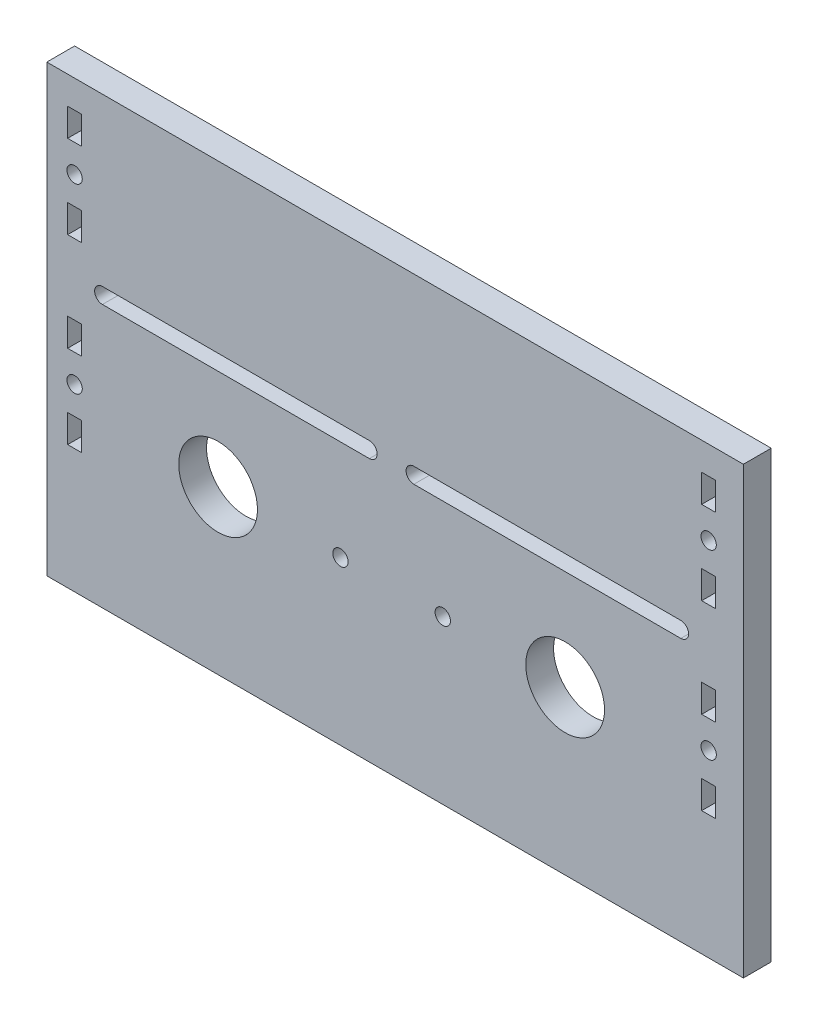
ISO-10303-21;
HEADER;
FILE_DESCRIPTION(('STEP AP214'),'2;1');
FILE_NAME('part.step','',(''),(''),'','','');
FILE_SCHEMA(('AUTOMOTIVE_DESIGN { 1 0 10303 214 1 1 1 1 }'));
ENDSEC;
DATA;
#1=APPLICATION_CONTEXT('core data for automotive mechanical design processes');
#2=APPLICATION_PROTOCOL_DEFINITION('international standard','automotive_design',2000,#1);
#3=PRODUCT_CONTEXT('',#1,'mechanical');
#4=PRODUCT('Part','Part','',(#3));
#5=PRODUCT_RELATED_PRODUCT_CATEGORY('part','',(#4));
#6=PRODUCT_DEFINITION_FORMATION('','',#4);
#7=PRODUCT_DEFINITION_CONTEXT('part definition',#1,'design');
#8=PRODUCT_DEFINITION('design','',#6,#7);
#9=PRODUCT_DEFINITION_SHAPE('','',#8);
#10=(LENGTH_UNIT() NAMED_UNIT(*) SI_UNIT(.MILLI.,.METRE.));
#11=(NAMED_UNIT(*) PLANE_ANGLE_UNIT() SI_UNIT($,.RADIAN.));
#12=(NAMED_UNIT(*) SI_UNIT($,.STERADIAN.) SOLID_ANGLE_UNIT());
#13=UNCERTAINTY_MEASURE_WITH_UNIT(LENGTH_MEASURE(1.E-05),#10,'distance_accuracy_value','');
#14=(GEOMETRIC_REPRESENTATION_CONTEXT(3) GLOBAL_UNCERTAINTY_ASSIGNED_CONTEXT((#13)) GLOBAL_UNIT_ASSIGNED_CONTEXT((#10,
#11,#12)) REPRESENTATION_CONTEXT('',''));
#15=CARTESIAN_POINT('',(0.,0.,0.));
#16=DIRECTION('',(0.,0.,1.));
#17=DIRECTION('',(1.,0.,0.));
#18=AXIS2_PLACEMENT_3D('',#15,#16,#17);
#19=CARTESIAN_POINT('',(-180.467167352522,-39.1474472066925,4.7625));
#20=DIRECTION('',(0.,0.,1.));
#21=DIRECTION('',(1.,0.,0.));
#22=AXIS2_PLACEMENT_3D('',#19,#20,#21);
#23=PLANE('',#22);
#24=CARTESIAN_POINT('',(-104.902167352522,-18.6306280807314,4.7625));
#25=DIRECTION('',(0.,0.,1.));
#26=DIRECTION('',(1.,0.,0.));
#27=AXIS2_PLACEMENT_3D('',#24,#25,#26);
#28=CIRCLE('',#27,0.876300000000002);
#29=CARTESIAN_POINT('',(-104.025867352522,-18.6306280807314,4.7625));
#30=VERTEX_POINT('',#29);
#31=EDGE_CURVE('E723',#30,#30,#28,.F.);
#32=ORIENTED_EDGE('',*,*,#31,.T.);
#33=EDGE_LOOP('',(#32));
#34=FACE_BOUND('',#33,.T.);
#35=DIRECTION('',(0.,1.,0.));
#36=VECTOR('',#35,1.);
#37=CARTESIAN_POINT('',(-105.695917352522,-39.1474472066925,4.7625));
#38=LINE('',#37,#36);
#39=CARTESIAN_POINT('',(-105.695917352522,-15.4556280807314,4.7625));
#40=VERTEX_POINT('',#39);
#41=CARTESIAN_POINT('',(-105.695917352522,-12.2806280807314,4.7625));
#42=VERTEX_POINT('',#41);
#43=EDGE_CURVE('E661',#40,#42,#38,.T.);
#44=ORIENTED_EDGE('',*,*,#43,.T.);
#45=DIRECTION('',(1.,0.,0.));
#46=VECTOR('',#45,1.);
#47=CARTESIAN_POINT('',(-180.467167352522,-12.2806280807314,4.7625));
#48=LINE('',#47,#46);
#49=CARTESIAN_POINT('',(-104.108417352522,-12.2806280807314,4.7625));
#50=VERTEX_POINT('',#49);
#51=EDGE_CURVE('E658',#42,#50,#48,.T.);
#52=ORIENTED_EDGE('',*,*,#51,.T.);
#53=DIRECTION('',(0.,-1.,0.));
#54=VECTOR('',#53,1.);
#55=CARTESIAN_POINT('',(-104.108417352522,-39.1474472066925,4.7625));
#56=LINE('',#55,#54);
#57=CARTESIAN_POINT('',(-104.108417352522,-15.4556280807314,4.7625));
#58=VERTEX_POINT('',#57);
#59=EDGE_CURVE('E667',#50,#58,#56,.T.);
#60=ORIENTED_EDGE('',*,*,#59,.T.);
#61=DIRECTION('',(-1.,0.,0.));
#62=VECTOR('',#61,1.);
#63=CARTESIAN_POINT('',(-180.467167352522,-15.4556280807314,4.7625));
#64=LINE('',#63,#62);
#65=EDGE_CURVE('E664',#58,#40,#64,.T.);
#66=ORIENTED_EDGE('',*,*,#65,.T.);
#67=EDGE_LOOP('',(#44,#52,#60,#66));
#68=FACE_BOUND('',#67,.T.);
#69=DIRECTION('',(-1.,0.,0.));
#70=VECTOR('',#69,1.);
#71=CARTESIAN_POINT('',(-180.467167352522,-4.22244720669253,4.7625));
#72=LINE('',#71,#70);
#73=CARTESIAN_POINT('',(-104.108417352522,-4.22244720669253,4.7625));
#74=VERTEX_POINT('',#73);
#75=CARTESIAN_POINT('',(-105.695917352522,-4.22244720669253,4.7625));
#76=VERTEX_POINT('',#75);
#77=EDGE_CURVE('E622',#74,#76,#72,.T.);
#78=ORIENTED_EDGE('',*,*,#77,.T.);
#79=DIRECTION('',(0.,1.,0.));
#80=VECTOR('',#79,1.);
#81=CARTESIAN_POINT('',(-105.695917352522,-39.1474472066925,4.7625));
#82=LINE('',#81,#80);
#83=CARTESIAN_POINT('',(-105.695917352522,-1.04744720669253,4.7625));
#84=VERTEX_POINT('',#83);
#85=EDGE_CURVE('E619',#76,#84,#82,.T.);
#86=ORIENTED_EDGE('',*,*,#85,.T.);
#87=DIRECTION('',(1.,0.,0.));
#88=VECTOR('',#87,1.);
#89=CARTESIAN_POINT('',(-180.467167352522,-1.04744720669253,4.7625));
#90=LINE('',#89,#88);
#91=CARTESIAN_POINT('',(-104.108417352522,-1.04744720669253,4.7625));
#92=VERTEX_POINT('',#91);
#93=EDGE_CURVE('E628',#84,#92,#90,.T.);
#94=ORIENTED_EDGE('',*,*,#93,.T.);
#95=DIRECTION('',(0.,-1.,0.));
#96=VECTOR('',#95,1.);
#97=CARTESIAN_POINT('',(-104.108417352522,-39.1474472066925,4.7625));
#98=LINE('',#97,#96);
#99=EDGE_CURVE('E625',#92,#74,#98,.T.);
#100=ORIENTED_EDGE('',*,*,#99,.T.);
#101=EDGE_LOOP('',(#78,#86,#94,#100));
#102=FACE_BOUND('',#101,.T.);
#103=CARTESIAN_POINT('',(-121.285167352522,-20.570537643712,4.7625));
#104=DIRECTION('',(0.,0.,1.));
#105=DIRECTION('',(1.,0.,0.));
#106=AXIS2_PLACEMENT_3D('',#103,#104,#105);
#107=CIRCLE('',#106,4.4958);
#108=CARTESIAN_POINT('',(-116.789367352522,-20.570537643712,4.7625));
#109=VERTEX_POINT('',#108);
#110=EDGE_CURVE('E580',#109,#109,#107,.F.);
#111=ORIENTED_EDGE('',*,*,#110,.T.);
#112=EDGE_LOOP('',(#111));
#113=FACE_BOUND('',#112,.T.);
#114=CARTESIAN_POINT('',(-146.939167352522,-20.570537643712,4.7625));
#115=DIRECTION('',(0.,0.,1.));
#116=DIRECTION('',(1.,0.,0.));
#117=AXIS2_PLACEMENT_3D('',#114,#115,#116);
#118=CIRCLE('',#117,0.876300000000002);
#119=CARTESIAN_POINT('',(-146.062867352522,-20.570537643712,4.7625));
#120=VERTEX_POINT('',#119);
#121=EDGE_CURVE('E568',#120,#120,#118,.F.);
#122=ORIENTED_EDGE('',*,*,#121,.T.);
#123=EDGE_LOOP('',(#122));
#124=FACE_BOUND('',#123,.T.);
#125=DIRECTION('',(-1.,0.,0.));
#126=VECTOR('',#125,1.);
#127=CARTESIAN_POINT('',(-180.467167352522,-9.14053764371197,4.7625));
#128=LINE('',#127,#126);
#129=CARTESIAN_POINT('',(-143.637167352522,-9.14053764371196,4.7625));
#130=VERTEX_POINT('',#129);
#131=CARTESIAN_POINT('',(-174.117167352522,-9.14053764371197,4.7625));
#132=VERTEX_POINT('',#131);
#133=EDGE_CURVE('E505',#130,#132,#128,.T.);
#134=ORIENTED_EDGE('',*,*,#133,.T.);
#135=CARTESIAN_POINT('',(-174.117167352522,-8.25153764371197,4.7625));
#136=DIRECTION('',(0.,0.,1.));
#137=DIRECTION('',(1.,0.,0.));
#138=AXIS2_PLACEMENT_3D('',#135,#136,#137);
#139=CIRCLE('',#138,0.889000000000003);
#140=CARTESIAN_POINT('',(-174.117167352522,-7.36253764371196,4.7625));
#141=VERTEX_POINT('',#140);
#142=EDGE_CURVE('E502',#132,#141,#139,.F.);
#143=ORIENTED_EDGE('',*,*,#142,.T.);
#144=DIRECTION('',(1.,0.,0.));
#145=VECTOR('',#144,1.);
#146=CARTESIAN_POINT('',(-180.467167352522,-7.36253764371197,4.7625));
#147=LINE('',#146,#145);
#148=CARTESIAN_POINT('',(-143.637167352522,-7.36253764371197,4.7625));
#149=VERTEX_POINT('',#148);
#150=EDGE_CURVE('E511',#141,#149,#147,.T.);
#151=ORIENTED_EDGE('',*,*,#150,.T.);
#152=CARTESIAN_POINT('',(-143.637167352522,-8.25153764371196,4.7625));
#153=DIRECTION('',(0.,0.,1.));
#154=DIRECTION('',(1.,0.,0.));
#155=AXIS2_PLACEMENT_3D('',#152,#153,#154);
#156=CIRCLE('',#155,0.889);
#157=EDGE_CURVE('E508',#149,#130,#156,.F.);
#158=ORIENTED_EDGE('',*,*,#157,.T.);
#159=EDGE_LOOP('',(#134,#143,#151,#158));
#160=FACE_BOUND('',#159,.T.);
#161=CARTESIAN_POINT('',(-160.909167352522,-20.570537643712,4.7625));
#162=DIRECTION('',(0.,0.,1.));
#163=DIRECTION('',(1.,0.,0.));
#164=AXIS2_PLACEMENT_3D('',#161,#162,#163);
#165=CIRCLE('',#164,4.49579999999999);
#166=CARTESIAN_POINT('',(-156.413367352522,-20.570537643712,4.7625));
#167=VERTEX_POINT('',#166);
#168=EDGE_CURVE('E490',#167,#167,#165,.F.);
#169=ORIENTED_EDGE('',*,*,#168,.T.);
#170=EDGE_LOOP('',(#169));
#171=FACE_BOUND('',#170,.T.);
#172=DIRECTION('',(-1.,0.,0.));
#173=VECTOR('',#172,1.);
#174=CARTESIAN_POINT('',(-180.467167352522,-15.4556280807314,4.7625));
#175=LINE('',#174,#173);
#176=CARTESIAN_POINT('',(-176.498417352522,-15.4556280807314,4.7625));
#177=VERTEX_POINT('',#176);
#178=CARTESIAN_POINT('',(-178.085917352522,-15.4556280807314,4.7625));
#179=VERTEX_POINT('',#178);
#180=EDGE_CURVE('E427',#177,#179,#175,.T.);
#181=ORIENTED_EDGE('',*,*,#180,.T.);
#182=DIRECTION('',(0.,1.,0.));
#183=VECTOR('',#182,1.);
#184=CARTESIAN_POINT('',(-178.085917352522,-39.1474472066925,4.7625));
#185=LINE('',#184,#183);
#186=CARTESIAN_POINT('',(-178.085917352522,-12.2806280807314,4.7625));
#187=VERTEX_POINT('',#186);
#188=EDGE_CURVE('E424',#179,#187,#185,.T.);
#189=ORIENTED_EDGE('',*,*,#188,.T.);
#190=DIRECTION('',(1.,0.,0.));
#191=VECTOR('',#190,1.);
#192=CARTESIAN_POINT('',(-180.467167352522,-12.2806280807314,4.7625));
#193=LINE('',#192,#191);
#194=CARTESIAN_POINT('',(-176.498417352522,-12.2806280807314,4.7625));
#195=VERTEX_POINT('',#194);
#196=EDGE_CURVE('E433',#187,#195,#193,.T.);
#197=ORIENTED_EDGE('',*,*,#196,.T.);
#198=DIRECTION('',(0.,-1.,0.));
#199=VECTOR('',#198,1.);
#200=CARTESIAN_POINT('',(-176.498417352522,-39.1474472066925,4.7625));
#201=LINE('',#200,#199);
#202=EDGE_CURVE('E430',#195,#177,#201,.T.);
#203=ORIENTED_EDGE('',*,*,#202,.T.);
#204=EDGE_LOOP('',(#181,#189,#197,#203));
#205=FACE_BOUND('',#204,.T.);
#206=DIRECTION('',(-1.,0.,0.));
#207=VECTOR('',#206,1.);
#208=CARTESIAN_POINT('',(-180.467167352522,-4.22244720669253,4.7625));
#209=LINE('',#208,#207);
#210=CARTESIAN_POINT('',(-176.498417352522,-4.22244720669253,4.7625));
#211=VERTEX_POINT('',#210);
#212=CARTESIAN_POINT('',(-178.085917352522,-4.22244720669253,4.7625));
#213=VERTEX_POINT('',#212);
#214=EDGE_CURVE('E388',#211,#213,#209,.T.);
#215=ORIENTED_EDGE('',*,*,#214,.T.);
#216=DIRECTION('',(0.,1.,0.));
#217=VECTOR('',#216,1.);
#218=CARTESIAN_POINT('',(-178.085917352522,-39.1474472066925,4.7625));
#219=LINE('',#218,#217);
#220=CARTESIAN_POINT('',(-178.085917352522,-1.04744720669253,4.7625));
#221=VERTEX_POINT('',#220);
#222=EDGE_CURVE('E385',#213,#221,#219,.T.);
#223=ORIENTED_EDGE('',*,*,#222,.T.);
#224=DIRECTION('',(1.,0.,0.));
#225=VECTOR('',#224,1.);
#226=CARTESIAN_POINT('',(-180.467167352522,-1.04744720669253,4.7625));
#227=LINE('',#226,#225);
#228=CARTESIAN_POINT('',(-176.498417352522,-1.04744720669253,4.7625));
#229=VERTEX_POINT('',#228);
#230=EDGE_CURVE('E394',#221,#229,#227,.T.);
#231=ORIENTED_EDGE('',*,*,#230,.T.);
#232=DIRECTION('',(0.,-1.,0.));
#233=VECTOR('',#232,1.);
#234=CARTESIAN_POINT('',(-176.498417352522,-39.1474472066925,4.7625));
#235=LINE('',#234,#233);
#236=EDGE_CURVE('E391',#229,#211,#235,.T.);
#237=ORIENTED_EDGE('',*,*,#236,.T.);
#238=EDGE_LOOP('',(#215,#223,#231,#237));
#239=FACE_BOUND('',#238,.T.);
#240=DIRECTION('',(-1.,0.,0.));
#241=VECTOR('',#240,1.);
#242=CARTESIAN_POINT('',(-180.467167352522,5.30255279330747,4.7625));
#243=LINE('',#242,#241);
#244=CARTESIAN_POINT('',(-176.498417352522,5.30255279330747,4.7625));
#245=VERTEX_POINT('',#244);
#246=CARTESIAN_POINT('',(-178.085917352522,5.30255279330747,4.7625));
#247=VERTEX_POINT('',#246);
#248=EDGE_CURVE('E355',#245,#247,#243,.T.);
#249=ORIENTED_EDGE('',*,*,#248,.T.);
#250=DIRECTION('',(0.,1.,0.));
#251=VECTOR('',#250,1.);
#252=CARTESIAN_POINT('',(-178.085917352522,-39.1474472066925,4.7625));
#253=LINE('',#252,#251);
#254=CARTESIAN_POINT('',(-178.085917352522,8.47755279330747,4.7625));
#255=VERTEX_POINT('',#254);
#256=EDGE_CURVE('E336',#247,#255,#253,.T.);
#257=ORIENTED_EDGE('',*,*,#256,.T.);
#258=DIRECTION('',(1.,0.,0.));
#259=VECTOR('',#258,1.);
#260=CARTESIAN_POINT('',(-180.467167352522,8.47755279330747,4.7625));
#261=LINE('',#260,#259);
#262=CARTESIAN_POINT('',(-176.498417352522,8.47755279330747,4.7625));
#263=VERTEX_POINT('',#262);
#264=EDGE_CURVE('E361',#255,#263,#261,.T.);
#265=ORIENTED_EDGE('',*,*,#264,.T.);
#266=DIRECTION('',(0.,-1.,0.));
#267=VECTOR('',#266,1.);
#268=CARTESIAN_POINT('',(-176.498417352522,-39.1474472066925,4.7625));
#269=LINE('',#268,#267);
#270=EDGE_CURVE('E358',#263,#245,#269,.T.);
#271=ORIENTED_EDGE('',*,*,#270,.T.);
#272=EDGE_LOOP('',(#249,#257,#265,#271));
#273=FACE_BOUND('',#272,.T.);
#274=CARTESIAN_POINT('',(-177.292167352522,2.12755279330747,4.7625));
#275=DIRECTION('',(0.,0.,1.));
#276=DIRECTION('',(1.,0.,0.));
#277=AXIS2_PLACEMENT_3D('',#274,#275,#276);
#278=CIRCLE('',#277,0.876300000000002);
#279=CARTESIAN_POINT('',(-176.415867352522,2.12755279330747,4.7625));
#280=VERTEX_POINT('',#279);
#281=EDGE_CURVE('E418',#280,#280,#278,.F.);
#282=ORIENTED_EDGE('',*,*,#281,.T.);
#283=EDGE_LOOP('',(#282));
#284=FACE_BOUND('',#283,.T.);
#285=DIRECTION('',(0.,1.,0.));
#286=VECTOR('',#285,1.);
#287=CARTESIAN_POINT('',(-178.085917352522,-39.1474472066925,4.7625));
#288=LINE('',#287,#286);
#289=CARTESIAN_POINT('',(-178.085917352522,-24.9806280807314,4.7625));
#290=VERTEX_POINT('',#289);
#291=CARTESIAN_POINT('',(-178.085917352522,-21.8056280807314,4.7625));
#292=VERTEX_POINT('',#291);
#293=EDGE_CURVE('E460',#290,#292,#288,.T.);
#294=ORIENTED_EDGE('',*,*,#293,.T.);
#295=DIRECTION('',(1.,0.,0.));
#296=VECTOR('',#295,1.);
#297=CARTESIAN_POINT('',(-180.467167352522,-21.8056280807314,4.7625));
#298=LINE('',#297,#296);
#299=CARTESIAN_POINT('',(-176.498417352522,-21.8056280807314,4.7625));
#300=VERTEX_POINT('',#299);
#301=EDGE_CURVE('E457',#292,#300,#298,.T.);
#302=ORIENTED_EDGE('',*,*,#301,.T.);
#303=DIRECTION('',(0.,-1.,0.));
#304=VECTOR('',#303,1.);
#305=CARTESIAN_POINT('',(-176.498417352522,-39.1474472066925,4.7625));
#306=LINE('',#305,#304);
#307=CARTESIAN_POINT('',(-176.498417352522,-24.9806280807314,4.7625));
#308=VERTEX_POINT('',#307);
#309=EDGE_CURVE('E466',#300,#308,#306,.T.);
#310=ORIENTED_EDGE('',*,*,#309,.T.);
#311=DIRECTION('',(-1.,0.,0.));
#312=VECTOR('',#311,1.);
#313=CARTESIAN_POINT('',(-180.467167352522,-24.9806280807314,4.7625));
#314=LINE('',#313,#312);
#315=EDGE_CURVE('E463',#308,#290,#314,.T.);
#316=ORIENTED_EDGE('',*,*,#315,.T.);
#317=EDGE_LOOP('',(#294,#302,#310,#316));
#318=FACE_BOUND('',#317,.T.);
#319=CARTESIAN_POINT('',(-177.292167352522,-18.6306280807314,4.7625));
#320=DIRECTION('',(0.,0.,1.));
#321=DIRECTION('',(1.,0.,0.));
#322=AXIS2_PLACEMENT_3D('',#319,#320,#321);
#323=CIRCLE('',#322,0.876300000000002);
#324=CARTESIAN_POINT('',(-176.415867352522,-18.6306280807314,4.7625));
#325=VERTEX_POINT('',#324);
#326=EDGE_CURVE('E496',#325,#325,#323,.F.);
#327=ORIENTED_EDGE('',*,*,#326,.T.);
#328=EDGE_LOOP('',(#327));
#329=FACE_BOUND('',#328,.T.);
#330=DIRECTION('',(1.,0.,0.));
#331=VECTOR('',#330,1.);
#332=CARTESIAN_POINT('',(-180.467167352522,-7.36253764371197,4.7625));
#333=LINE('',#332,#331);
#334=CARTESIAN_POINT('',(-138.557167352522,-7.36253764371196,4.7625));
#335=VERTEX_POINT('',#334);
#336=CARTESIAN_POINT('',(-108.077167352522,-7.36253764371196,4.7625));
#337=VERTEX_POINT('',#336);
#338=EDGE_CURVE('E538',#335,#337,#333,.T.);
#339=ORIENTED_EDGE('',*,*,#338,.T.);
#340=CARTESIAN_POINT('',(-108.077167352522,-8.25153764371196,4.7625));
#341=DIRECTION('',(0.,0.,1.));
#342=DIRECTION('',(1.,0.,0.));
#343=AXIS2_PLACEMENT_3D('',#340,#341,#342);
#344=CIRCLE('',#343,0.889000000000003);
#345=CARTESIAN_POINT('',(-108.077167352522,-9.14053764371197,4.7625));
#346=VERTEX_POINT('',#345);
#347=EDGE_CURVE('E535',#337,#346,#344,.F.);
#348=ORIENTED_EDGE('',*,*,#347,.T.);
#349=DIRECTION('',(-1.,0.,0.));
#350=VECTOR('',#349,1.);
#351=CARTESIAN_POINT('',(-180.467167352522,-9.14053764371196,4.7625));
#352=LINE('',#351,#350);
#353=CARTESIAN_POINT('',(-138.557167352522,-9.14053764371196,4.7625));
#354=VERTEX_POINT('',#353);
#355=EDGE_CURVE('E544',#346,#354,#352,.T.);
#356=ORIENTED_EDGE('',*,*,#355,.T.);
#357=CARTESIAN_POINT('',(-138.557167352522,-8.25153764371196,4.7625));
#358=DIRECTION('',(0.,0.,1.));
#359=DIRECTION('',(1.,0.,0.));
#360=AXIS2_PLACEMENT_3D('',#357,#358,#359);
#361=CIRCLE('',#360,0.889);
#362=EDGE_CURVE('E541',#354,#335,#361,.F.);
#363=ORIENTED_EDGE('',*,*,#362,.T.);
#364=EDGE_LOOP('',(#339,#348,#356,#363));
#365=FACE_BOUND('',#364,.T.);
#366=CARTESIAN_POINT('',(-135.255167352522,-20.570537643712,4.7625));
#367=DIRECTION('',(0.,0.,1.));
#368=DIRECTION('',(1.,0.,0.));
#369=AXIS2_PLACEMENT_3D('',#366,#367,#368);
#370=CIRCLE('',#369,0.876300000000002);
#371=CARTESIAN_POINT('',(-134.378867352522,-20.570537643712,4.7625));
#372=VERTEX_POINT('',#371);
#373=EDGE_CURVE('E574',#372,#372,#370,.F.);
#374=ORIENTED_EDGE('',*,*,#373,.T.);
#375=EDGE_LOOP('',(#374));
#376=FACE_BOUND('',#375,.T.);
#377=DIRECTION('',(-1.,0.,0.));
#378=VECTOR('',#377,1.);
#379=CARTESIAN_POINT('',(-180.467167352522,5.30255279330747,4.7625));
#380=LINE('',#379,#378);
#381=CARTESIAN_POINT('',(-104.108417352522,5.30255279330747,4.7625));
#382=VERTEX_POINT('',#381);
#383=CARTESIAN_POINT('',(-105.695917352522,5.30255279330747,4.7625));
#384=VERTEX_POINT('',#383);
#385=EDGE_CURVE('E589',#382,#384,#380,.T.);
#386=ORIENTED_EDGE('',*,*,#385,.T.);
#387=DIRECTION('',(0.,1.,0.));
#388=VECTOR('',#387,1.);
#389=CARTESIAN_POINT('',(-105.695917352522,-39.1474472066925,4.7625));
#390=LINE('',#389,#388);
#391=CARTESIAN_POINT('',(-105.695917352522,8.47755279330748,4.7625));
#392=VERTEX_POINT('',#391);
#393=EDGE_CURVE('E586',#384,#392,#390,.T.);
#394=ORIENTED_EDGE('',*,*,#393,.T.);
#395=DIRECTION('',(1.,0.,0.));
#396=VECTOR('',#395,1.);
#397=CARTESIAN_POINT('',(-180.467167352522,8.47755279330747,4.7625));
#398=LINE('',#397,#396);
#399=CARTESIAN_POINT('',(-104.108417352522,8.47755279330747,4.7625));
#400=VERTEX_POINT('',#399);
#401=EDGE_CURVE('E595',#392,#400,#398,.T.);
#402=ORIENTED_EDGE('',*,*,#401,.T.);
#403=DIRECTION('',(0.,-1.,0.));
#404=VECTOR('',#403,1.);
#405=CARTESIAN_POINT('',(-104.108417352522,-39.1474472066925,4.7625));
#406=LINE('',#405,#404);
#407=EDGE_CURVE('E592',#400,#382,#406,.T.);
#408=ORIENTED_EDGE('',*,*,#407,.T.);
#409=EDGE_LOOP('',(#386,#394,#402,#408));
#410=FACE_BOUND('',#409,.T.);
#411=CARTESIAN_POINT('',(-104.902167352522,2.12755279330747,4.7625));
#412=DIRECTION('',(0.,0.,1.));
#413=DIRECTION('',(1.,0.,0.));
#414=AXIS2_PLACEMENT_3D('',#411,#412,#413);
#415=CIRCLE('',#414,0.876300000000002);
#416=CARTESIAN_POINT('',(-104.025867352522,2.12755279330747,4.7625));
#417=VERTEX_POINT('',#416);
#418=EDGE_CURVE('E652',#417,#417,#415,.F.);
#419=ORIENTED_EDGE('',*,*,#418,.T.);
#420=EDGE_LOOP('',(#419));
#421=FACE_BOUND('',#420,.T.);
#422=DIRECTION('',(-1.,0.,0.));
#423=VECTOR('',#422,1.);
#424=CARTESIAN_POINT('',(-180.467167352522,-24.9806280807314,4.7625));
#425=LINE('',#424,#423);
#426=CARTESIAN_POINT('',(-104.108417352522,-24.9806280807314,4.7625));
#427=VERTEX_POINT('',#426);
#428=CARTESIAN_POINT('',(-105.695917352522,-24.9806280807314,4.7625));
#429=VERTEX_POINT('',#428);
#430=EDGE_CURVE('E694',#427,#429,#425,.T.);
#431=ORIENTED_EDGE('',*,*,#430,.T.);
#432=DIRECTION('',(0.,1.,0.));
#433=VECTOR('',#432,1.);
#434=CARTESIAN_POINT('',(-105.695917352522,-39.1474472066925,4.7625));
#435=LINE('',#434,#433);
#436=CARTESIAN_POINT('',(-105.695917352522,-21.8056280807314,4.7625));
#437=VERTEX_POINT('',#436);
#438=EDGE_CURVE('E691',#429,#437,#435,.T.);
#439=ORIENTED_EDGE('',*,*,#438,.T.);
#440=DIRECTION('',(1.,0.,0.));
#441=VECTOR('',#440,1.);
#442=CARTESIAN_POINT('',(-180.467167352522,-21.8056280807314,4.7625));
#443=LINE('',#442,#441);
#444=CARTESIAN_POINT('',(-104.108417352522,-21.8056280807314,4.7625));
#445=VERTEX_POINT('',#444);
#446=EDGE_CURVE('E700',#437,#445,#443,.T.);
#447=ORIENTED_EDGE('',*,*,#446,.T.);
#448=DIRECTION('',(0.,-1.,0.));
#449=VECTOR('',#448,1.);
#450=CARTESIAN_POINT('',(-104.108417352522,-39.1474472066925,4.7625));
#451=LINE('',#450,#449);
#452=EDGE_CURVE('E697',#445,#427,#451,.T.);
#453=ORIENTED_EDGE('',*,*,#452,.T.);
#454=EDGE_LOOP('',(#431,#439,#447,#453));
#455=FACE_BOUND('',#454,.T.);
#456=DIRECTION('',(1.,0.,0.));
#457=VECTOR('',#456,1.);
#458=CARTESIAN_POINT('',(-180.467167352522,-39.1474472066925,4.7625));
#459=LINE('',#458,#457);
#460=CARTESIAN_POINT('',(-180.467167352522,-39.1474472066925,4.7625));
#461=VERTEX_POINT('',#460);
#462=CARTESIAN_POINT('',(-100.933417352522,-39.1474472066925,4.7625));
#463=VERTEX_POINT('',#462);
#464=EDGE_CURVE('E346',#461,#463,#459,.T.);
#465=ORIENTED_EDGE('',*,*,#464,.T.);
#466=DIRECTION('',(0.,1.,0.));
#467=VECTOR('',#466,1.);
#468=CARTESIAN_POINT('',(-100.933417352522,-39.1474472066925,4.7625));
#469=LINE('',#468,#467);
#470=CARTESIAN_POINT('',(-100.933417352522,11.6525527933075,4.7625));
#471=VERTEX_POINT('',#470);
#472=EDGE_CURVE('E316',#463,#471,#469,.T.);
#473=ORIENTED_EDGE('',*,*,#472,.T.);
#474=DIRECTION('',(-1.,0.,0.));
#475=VECTOR('',#474,1.);
#476=CARTESIAN_POINT('',(-180.467167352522,11.6525527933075,4.7625));
#477=LINE('',#476,#475);
#478=CARTESIAN_POINT('',(-180.467167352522,11.6525527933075,4.7625));
#479=VERTEX_POINT('',#478);
#480=EDGE_CURVE('E342',#471,#479,#477,.T.);
#481=ORIENTED_EDGE('',*,*,#480,.T.);
#482=DIRECTION('',(0.,-1.,0.));
#483=VECTOR('',#482,1.);
#484=CARTESIAN_POINT('',(-180.467167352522,11.6525527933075,4.7625));
#485=LINE('',#484,#483);
#486=EDGE_CURVE('E334',#479,#461,#485,.T.);
#487=ORIENTED_EDGE('',*,*,#486,.T.);
#488=EDGE_LOOP('',(#465,#473,#481,#487));
#489=FACE_BOUND('',#488,.T.);
#490=ADVANCED_FACE('F35',(#34,#68,#102,#113,#124,#160,#171,#205,#239,#273,#284,#318,#329,#365,
#376,#410,#421,#455,#489),#23,.T.);
#491=CARTESIAN_POINT('',(-180.467167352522,-39.1474472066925,1.5875));
#492=DIRECTION('',(0.,0.,1.));
#493=DIRECTION('',(1.,0.,0.));
#494=AXIS2_PLACEMENT_3D('',#491,#492,#493);
#495=PLANE('',#494);
#496=CARTESIAN_POINT('',(-104.902167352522,-18.6306280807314,1.5875));
#497=DIRECTION('',(0.,0.,1.));
#498=DIRECTION('',(1.,0.,0.));
#499=AXIS2_PLACEMENT_3D('',#496,#497,#498);
#500=CIRCLE('',#499,0.876300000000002);
#501=CARTESIAN_POINT('',(-104.025867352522,-18.6306280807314,1.5875));
#502=VERTEX_POINT('',#501);
#503=EDGE_CURVE('E726',#502,#502,#500,.T.);
#504=ORIENTED_EDGE('',*,*,#503,.T.);
#505=EDGE_LOOP('',(#504));
#506=FACE_BOUND('',#505,.T.);
#507=DIRECTION('',(-1.,0.,0.));
#508=VECTOR('',#507,1.);
#509=CARTESIAN_POINT('',(-105.695917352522,-12.2806280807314,1.5875));
#510=LINE('',#509,#508);
#511=CARTESIAN_POINT('',(-104.108417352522,-12.2806280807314,1.5875));
#512=VERTEX_POINT('',#511);
#513=CARTESIAN_POINT('',(-105.695917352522,-12.2806280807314,1.5875));
#514=VERTEX_POINT('',#513);
#515=EDGE_CURVE('E688',#512,#514,#510,.T.);
#516=ORIENTED_EDGE('',*,*,#515,.T.);
#517=DIRECTION('',(0.,-1.,0.));
#518=VECTOR('',#517,1.);
#519=CARTESIAN_POINT('',(-105.695917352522,-12.2806280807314,1.5875));
#520=LINE('',#519,#518);
#521=CARTESIAN_POINT('',(-105.695917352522,-15.4556280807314,1.5875));
#522=VERTEX_POINT('',#521);
#523=EDGE_CURVE('E685',#514,#522,#520,.T.);
#524=ORIENTED_EDGE('',*,*,#523,.T.);
#525=DIRECTION('',(1.,0.,0.));
#526=VECTOR('',#525,1.);
#527=CARTESIAN_POINT('',(-105.695917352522,-15.4556280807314,1.5875));
#528=LINE('',#527,#526);
#529=CARTESIAN_POINT('',(-104.108417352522,-15.4556280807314,1.5875));
#530=VERTEX_POINT('',#529);
#531=EDGE_CURVE('E682',#522,#530,#528,.T.);
#532=ORIENTED_EDGE('',*,*,#531,.T.);
#533=DIRECTION('',(0.,1.,0.));
#534=VECTOR('',#533,1.);
#535=CARTESIAN_POINT('',(-104.108417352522,-12.2806280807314,1.5875));
#536=LINE('',#535,#534);
#537=EDGE_CURVE('E679',#530,#512,#536,.T.);
#538=ORIENTED_EDGE('',*,*,#537,.T.);
#539=EDGE_LOOP('',(#516,#524,#532,#538));
#540=FACE_BOUND('',#539,.T.);
#541=DIRECTION('',(0.,-1.,0.));
#542=VECTOR('',#541,1.);
#543=CARTESIAN_POINT('',(-105.695917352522,-1.04744720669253,1.5875));
#544=LINE('',#543,#542);
#545=CARTESIAN_POINT('',(-105.695917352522,-1.04744720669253,1.5875));
#546=VERTEX_POINT('',#545);
#547=CARTESIAN_POINT('',(-105.695917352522,-4.22244720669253,1.5875));
#548=VERTEX_POINT('',#547);
#549=EDGE_CURVE('E649',#546,#548,#544,.T.);
#550=ORIENTED_EDGE('',*,*,#549,.T.);
#551=DIRECTION('',(1.,0.,0.));
#552=VECTOR('',#551,1.);
#553=CARTESIAN_POINT('',(-105.695917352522,-4.22244720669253,1.5875));
#554=LINE('',#553,#552);
#555=CARTESIAN_POINT('',(-104.108417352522,-4.22244720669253,1.5875));
#556=VERTEX_POINT('',#555);
#557=EDGE_CURVE('E646',#548,#556,#554,.T.);
#558=ORIENTED_EDGE('',*,*,#557,.T.);
#559=DIRECTION('',(0.,1.,0.));
#560=VECTOR('',#559,1.);
#561=CARTESIAN_POINT('',(-104.108417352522,-1.04744720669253,1.5875));
#562=LINE('',#561,#560);
#563=CARTESIAN_POINT('',(-104.108417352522,-1.04744720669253,1.5875));
#564=VERTEX_POINT('',#563);
#565=EDGE_CURVE('E643',#556,#564,#562,.T.);
#566=ORIENTED_EDGE('',*,*,#565,.T.);
#567=DIRECTION('',(-1.,0.,0.));
#568=VECTOR('',#567,1.);
#569=CARTESIAN_POINT('',(-105.695917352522,-1.04744720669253,1.5875));
#570=LINE('',#569,#568);
#571=EDGE_CURVE('E640',#564,#546,#570,.T.);
#572=ORIENTED_EDGE('',*,*,#571,.T.);
#573=EDGE_LOOP('',(#550,#558,#566,#572));
#574=FACE_BOUND('',#573,.T.);
#575=CARTESIAN_POINT('',(-121.285167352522,-20.570537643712,1.5875));
#576=DIRECTION('',(0.,0.,1.));
#577=DIRECTION('',(1.,0.,0.));
#578=AXIS2_PLACEMENT_3D('',#575,#576,#577);
#579=CIRCLE('',#578,4.4958);
#580=CARTESIAN_POINT('',(-116.789367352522,-20.570537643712,1.5875));
#581=VERTEX_POINT('',#580);
#582=EDGE_CURVE('E583',#581,#581,#579,.T.);
#583=ORIENTED_EDGE('',*,*,#582,.T.);
#584=EDGE_LOOP('',(#583));
#585=FACE_BOUND('',#584,.T.);
#586=CARTESIAN_POINT('',(-146.939167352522,-20.570537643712,1.5875));
#587=DIRECTION('',(0.,0.,1.));
#588=DIRECTION('',(1.,0.,0.));
#589=AXIS2_PLACEMENT_3D('',#586,#587,#588);
#590=CIRCLE('',#589,0.876300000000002);
#591=CARTESIAN_POINT('',(-146.062867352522,-20.570537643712,1.5875));
#592=VERTEX_POINT('',#591);
#593=EDGE_CURVE('E571',#592,#592,#590,.T.);
#594=ORIENTED_EDGE('',*,*,#593,.T.);
#595=EDGE_LOOP('',(#594));
#596=FACE_BOUND('',#595,.T.);
#597=CARTESIAN_POINT('',(-174.117167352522,-8.25153764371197,1.5875));
#598=DIRECTION('',(0.,0.,1.));
#599=DIRECTION('',(1.,0.,0.));
#600=AXIS2_PLACEMENT_3D('',#597,#598,#599);
#601=CIRCLE('',#600,0.889000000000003);
#602=CARTESIAN_POINT('',(-174.117167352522,-7.36253764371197,1.5875));
#603=VERTEX_POINT('',#602);
#604=CARTESIAN_POINT('',(-174.117167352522,-9.14053764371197,1.5875));
#605=VERTEX_POINT('',#604);
#606=EDGE_CURVE('E532',#603,#605,#601,.T.);
#607=ORIENTED_EDGE('',*,*,#606,.T.);
#608=DIRECTION('',(1.,0.,0.));
#609=VECTOR('',#608,1.);
#610=CARTESIAN_POINT('',(-174.117167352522,-9.14053764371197,1.5875));
#611=LINE('',#610,#609);
#612=CARTESIAN_POINT('',(-143.637167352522,-9.14053764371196,1.5875));
#613=VERTEX_POINT('',#612);
#614=EDGE_CURVE('E529',#605,#613,#611,.T.);
#615=ORIENTED_EDGE('',*,*,#614,.T.);
#616=CARTESIAN_POINT('',(-143.637167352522,-8.25153764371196,1.5875));
#617=DIRECTION('',(0.,0.,1.));
#618=DIRECTION('',(1.,0.,0.));
#619=AXIS2_PLACEMENT_3D('',#616,#617,#618);
#620=CIRCLE('',#619,0.889);
#621=CARTESIAN_POINT('',(-143.637167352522,-7.36253764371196,1.5875));
#622=VERTEX_POINT('',#621);
#623=EDGE_CURVE('E526',#613,#622,#620,.T.);
#624=ORIENTED_EDGE('',*,*,#623,.T.);
#625=DIRECTION('',(-1.,0.,0.));
#626=VECTOR('',#625,1.);
#627=CARTESIAN_POINT('',(-174.117167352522,-7.36253764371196,1.5875));
#628=LINE('',#627,#626);
#629=EDGE_CURVE('E523',#622,#603,#628,.T.);
#630=ORIENTED_EDGE('',*,*,#629,.T.);
#631=EDGE_LOOP('',(#607,#615,#624,#630));
#632=FACE_BOUND('',#631,.T.);
#633=CARTESIAN_POINT('',(-160.909167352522,-20.570537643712,1.5875));
#634=DIRECTION('',(0.,0.,1.));
#635=DIRECTION('',(1.,0.,0.));
#636=AXIS2_PLACEMENT_3D('',#633,#634,#635);
#637=CIRCLE('',#636,4.49579999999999);
#638=CARTESIAN_POINT('',(-156.413367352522,-20.570537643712,1.5875));
#639=VERTEX_POINT('',#638);
#640=EDGE_CURVE('E493',#639,#639,#637,.T.);
#641=ORIENTED_EDGE('',*,*,#640,.T.);
#642=EDGE_LOOP('',(#641));
#643=FACE_BOUND('',#642,.T.);
#644=DIRECTION('',(0.,-1.,0.));
#645=VECTOR('',#644,1.);
#646=CARTESIAN_POINT('',(-178.085917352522,-12.2806280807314,1.5875));
#647=LINE('',#646,#645);
#648=CARTESIAN_POINT('',(-178.085917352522,-12.2806280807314,1.5875));
#649=VERTEX_POINT('',#648);
#650=CARTESIAN_POINT('',(-178.085917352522,-15.4556280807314,1.5875));
#651=VERTEX_POINT('',#650);
#652=EDGE_CURVE('E454',#649,#651,#647,.T.);
#653=ORIENTED_EDGE('',*,*,#652,.T.);
#654=DIRECTION('',(1.,0.,0.));
#655=VECTOR('',#654,1.);
#656=CARTESIAN_POINT('',(-178.085917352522,-15.4556280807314,1.5875));
#657=LINE('',#656,#655);
#658=CARTESIAN_POINT('',(-176.498417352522,-15.4556280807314,1.5875));
#659=VERTEX_POINT('',#658);
#660=EDGE_CURVE('E451',#651,#659,#657,.T.);
#661=ORIENTED_EDGE('',*,*,#660,.T.);
#662=DIRECTION('',(0.,1.,0.));
#663=VECTOR('',#662,1.);
#664=CARTESIAN_POINT('',(-176.498417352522,-12.2806280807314,1.5875));
#665=LINE('',#664,#663);
#666=CARTESIAN_POINT('',(-176.498417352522,-12.2806280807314,1.5875));
#667=VERTEX_POINT('',#666);
#668=EDGE_CURVE('E448',#659,#667,#665,.T.);
#669=ORIENTED_EDGE('',*,*,#668,.T.);
#670=DIRECTION('',(-1.,0.,0.));
#671=VECTOR('',#670,1.);
#672=CARTESIAN_POINT('',(-178.085917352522,-12.2806280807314,1.5875));
#673=LINE('',#672,#671);
#674=EDGE_CURVE('E445',#667,#649,#673,.T.);
#675=ORIENTED_EDGE('',*,*,#674,.T.);
#676=EDGE_LOOP('',(#653,#661,#669,#675));
#677=FACE_BOUND('',#676,.T.);
#678=DIRECTION('',(0.,-1.,0.));
#679=VECTOR('',#678,1.);
#680=CARTESIAN_POINT('',(-178.085917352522,-1.04744720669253,1.5875));
#681=LINE('',#680,#679);
#682=CARTESIAN_POINT('',(-178.085917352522,-1.04744720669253,1.5875));
#683=VERTEX_POINT('',#682);
#684=CARTESIAN_POINT('',(-178.085917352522,-4.22244720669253,1.5875));
#685=VERTEX_POINT('',#684);
#686=EDGE_CURVE('E415',#683,#685,#681,.T.);
#687=ORIENTED_EDGE('',*,*,#686,.T.);
#688=DIRECTION('',(1.,0.,0.));
#689=VECTOR('',#688,1.);
#690=CARTESIAN_POINT('',(-178.085917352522,-4.22244720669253,1.5875));
#691=LINE('',#690,#689);
#692=CARTESIAN_POINT('',(-176.498417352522,-4.22244720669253,1.5875));
#693=VERTEX_POINT('',#692);
#694=EDGE_CURVE('E412',#685,#693,#691,.T.);
#695=ORIENTED_EDGE('',*,*,#694,.T.);
#696=DIRECTION('',(0.,1.,0.));
#697=VECTOR('',#696,1.);
#698=CARTESIAN_POINT('',(-176.498417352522,-1.04744720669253,1.5875));
#699=LINE('',#698,#697);
#700=CARTESIAN_POINT('',(-176.498417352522,-1.04744720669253,1.5875));
#701=VERTEX_POINT('',#700);
#702=EDGE_CURVE('E409',#693,#701,#699,.T.);
#703=ORIENTED_EDGE('',*,*,#702,.T.);
#704=DIRECTION('',(-1.,0.,0.));
#705=VECTOR('',#704,1.);
#706=CARTESIAN_POINT('',(-178.085917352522,-1.04744720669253,1.5875));
#707=LINE('',#706,#705);
#708=EDGE_CURVE('E406',#701,#683,#707,.T.);
#709=ORIENTED_EDGE('',*,*,#708,.T.);
#710=EDGE_LOOP('',(#687,#695,#703,#709));
#711=FACE_BOUND('',#710,.T.);
#712=DIRECTION('',(0.,-1.,0.));
#713=VECTOR('',#712,1.);
#714=CARTESIAN_POINT('',(-178.085917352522,8.47755279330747,1.5875));
#715=LINE('',#714,#713);
#716=CARTESIAN_POINT('',(-178.085917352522,8.47755279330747,1.5875));
#717=VERTEX_POINT('',#716);
#718=CARTESIAN_POINT('',(-178.085917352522,5.30255279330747,1.5875));
#719=VERTEX_POINT('',#718);
#720=EDGE_CURVE('E382',#717,#719,#715,.T.);
#721=ORIENTED_EDGE('',*,*,#720,.T.);
#722=DIRECTION('',(1.,0.,0.));
#723=VECTOR('',#722,1.);
#724=CARTESIAN_POINT('',(-178.085917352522,5.30255279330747,1.5875));
#725=LINE('',#724,#723);
#726=CARTESIAN_POINT('',(-176.498417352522,5.30255279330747,1.5875));
#727=VERTEX_POINT('',#726);
#728=EDGE_CURVE('E379',#719,#727,#725,.T.);
#729=ORIENTED_EDGE('',*,*,#728,.T.);
#730=DIRECTION('',(0.,1.,0.));
#731=VECTOR('',#730,1.);
#732=CARTESIAN_POINT('',(-176.498417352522,8.47755279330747,1.5875));
#733=LINE('',#732,#731);
#734=CARTESIAN_POINT('',(-176.498417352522,8.47755279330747,1.5875));
#735=VERTEX_POINT('',#734);
#736=EDGE_CURVE('E376',#727,#735,#733,.T.);
#737=ORIENTED_EDGE('',*,*,#736,.T.);
#738=DIRECTION('',(-1.,0.,0.));
#739=VECTOR('',#738,1.);
#740=CARTESIAN_POINT('',(-178.085917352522,8.47755279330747,1.5875));
#741=LINE('',#740,#739);
#742=EDGE_CURVE('E373',#735,#717,#741,.T.);
#743=ORIENTED_EDGE('',*,*,#742,.T.);
#744=EDGE_LOOP('',(#721,#729,#737,#743));
#745=FACE_BOUND('',#744,.T.);
#746=CARTESIAN_POINT('',(-177.292167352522,2.12755279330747,1.5875));
#747=DIRECTION('',(0.,0.,1.));
#748=DIRECTION('',(1.,0.,0.));
#749=AXIS2_PLACEMENT_3D('',#746,#747,#748);
#750=CIRCLE('',#749,0.876300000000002);
#751=CARTESIAN_POINT('',(-176.415867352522,2.12755279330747,1.5875));
#752=VERTEX_POINT('',#751);
#753=EDGE_CURVE('E421',#752,#752,#750,.T.);
#754=ORIENTED_EDGE('',*,*,#753,.T.);
#755=EDGE_LOOP('',(#754));
#756=FACE_BOUND('',#755,.T.);
#757=DIRECTION('',(-1.,0.,0.));
#758=VECTOR('',#757,1.);
#759=CARTESIAN_POINT('',(-178.085917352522,-21.8056280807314,1.5875));
#760=LINE('',#759,#758);
#761=CARTESIAN_POINT('',(-176.498417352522,-21.8056280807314,1.5875));
#762=VERTEX_POINT('',#761);
#763=CARTESIAN_POINT('',(-178.085917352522,-21.8056280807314,1.5875));
#764=VERTEX_POINT('',#763);
#765=EDGE_CURVE('E487',#762,#764,#760,.T.);
#766=ORIENTED_EDGE('',*,*,#765,.T.);
#767=DIRECTION('',(0.,-1.,0.));
#768=VECTOR('',#767,1.);
#769=CARTESIAN_POINT('',(-178.085917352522,-21.8056280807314,1.5875));
#770=LINE('',#769,#768);
#771=CARTESIAN_POINT('',(-178.085917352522,-24.9806280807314,1.5875));
#772=VERTEX_POINT('',#771);
#773=EDGE_CURVE('E484',#764,#772,#770,.T.);
#774=ORIENTED_EDGE('',*,*,#773,.T.);
#775=DIRECTION('',(1.,0.,0.));
#776=VECTOR('',#775,1.);
#777=CARTESIAN_POINT('',(-178.085917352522,-24.9806280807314,1.5875));
#778=LINE('',#777,#776);
#779=CARTESIAN_POINT('',(-176.498417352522,-24.9806280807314,1.5875));
#780=VERTEX_POINT('',#779);
#781=EDGE_CURVE('E481',#772,#780,#778,.T.);
#782=ORIENTED_EDGE('',*,*,#781,.T.);
#783=DIRECTION('',(0.,1.,0.));
#784=VECTOR('',#783,1.);
#785=CARTESIAN_POINT('',(-176.498417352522,-21.8056280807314,1.5875));
#786=LINE('',#785,#784);
#787=EDGE_CURVE('E478',#780,#762,#786,.T.);
#788=ORIENTED_EDGE('',*,*,#787,.T.);
#789=EDGE_LOOP('',(#766,#774,#782,#788));
#790=FACE_BOUND('',#789,.T.);
#791=CARTESIAN_POINT('',(-177.292167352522,-18.6306280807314,1.5875));
#792=DIRECTION('',(0.,0.,1.));
#793=DIRECTION('',(1.,0.,0.));
#794=AXIS2_PLACEMENT_3D('',#791,#792,#793);
#795=CIRCLE('',#794,0.876300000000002);
#796=CARTESIAN_POINT('',(-176.415867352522,-18.6306280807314,1.5875));
#797=VERTEX_POINT('',#796);
#798=EDGE_CURVE('E499',#797,#797,#795,.T.);
#799=ORIENTED_EDGE('',*,*,#798,.T.);
#800=EDGE_LOOP('',(#799));
#801=FACE_BOUND('',#800,.T.);
#802=CARTESIAN_POINT('',(-108.077167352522,-8.25153764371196,1.5875));
#803=DIRECTION('',(0.,0.,1.));
#804=DIRECTION('',(1.,0.,0.));
#805=AXIS2_PLACEMENT_3D('',#802,#803,#804);
#806=CIRCLE('',#805,0.889000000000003);
#807=CARTESIAN_POINT('',(-108.077167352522,-9.14053764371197,1.5875));
#808=VERTEX_POINT('',#807);
#809=CARTESIAN_POINT('',(-108.077167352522,-7.36253764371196,1.5875));
#810=VERTEX_POINT('',#809);
#811=EDGE_CURVE('E565',#808,#810,#806,.T.);
#812=ORIENTED_EDGE('',*,*,#811,.T.);
#813=DIRECTION('',(-1.,0.,0.));
#814=VECTOR('',#813,1.);
#815=CARTESIAN_POINT('',(-108.077167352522,-7.36253764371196,1.5875));
#816=LINE('',#815,#814);
#817=CARTESIAN_POINT('',(-138.557167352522,-7.36253764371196,1.5875));
#818=VERTEX_POINT('',#817);
#819=EDGE_CURVE('E562',#810,#818,#816,.T.);
#820=ORIENTED_EDGE('',*,*,#819,.T.);
#821=CARTESIAN_POINT('',(-138.557167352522,-8.25153764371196,1.5875));
#822=DIRECTION('',(0.,0.,1.));
#823=DIRECTION('',(1.,0.,0.));
#824=AXIS2_PLACEMENT_3D('',#821,#822,#823);
#825=CIRCLE('',#824,0.889);
#826=CARTESIAN_POINT('',(-138.557167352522,-9.14053764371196,1.5875));
#827=VERTEX_POINT('',#826);
#828=EDGE_CURVE('E559',#818,#827,#825,.T.);
#829=ORIENTED_EDGE('',*,*,#828,.T.);
#830=DIRECTION('',(1.,0.,0.));
#831=VECTOR('',#830,1.);
#832=CARTESIAN_POINT('',(-108.077167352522,-9.14053764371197,1.5875));
#833=LINE('',#832,#831);
#834=EDGE_CURVE('E556',#827,#808,#833,.T.);
#835=ORIENTED_EDGE('',*,*,#834,.T.);
#836=EDGE_LOOP('',(#812,#820,#829,#835));
#837=FACE_BOUND('',#836,.T.);
#838=CARTESIAN_POINT('',(-135.255167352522,-20.570537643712,1.5875));
#839=DIRECTION('',(0.,0.,1.));
#840=DIRECTION('',(1.,0.,0.));
#841=AXIS2_PLACEMENT_3D('',#838,#839,#840);
#842=CIRCLE('',#841,0.876300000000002);
#843=CARTESIAN_POINT('',(-134.378867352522,-20.570537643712,1.5875));
#844=VERTEX_POINT('',#843);
#845=EDGE_CURVE('E577',#844,#844,#842,.T.);
#846=ORIENTED_EDGE('',*,*,#845,.T.);
#847=EDGE_LOOP('',(#846));
#848=FACE_BOUND('',#847,.T.);
#849=DIRECTION('',(0.,-1.,0.));
#850=VECTOR('',#849,1.);
#851=CARTESIAN_POINT('',(-105.695917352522,8.47755279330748,1.5875));
#852=LINE('',#851,#850);
#853=CARTESIAN_POINT('',(-105.695917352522,8.47755279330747,1.5875));
#854=VERTEX_POINT('',#853);
#855=CARTESIAN_POINT('',(-105.695917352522,5.30255279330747,1.5875));
#856=VERTEX_POINT('',#855);
#857=EDGE_CURVE('E616',#854,#856,#852,.T.);
#858=ORIENTED_EDGE('',*,*,#857,.T.);
#859=DIRECTION('',(1.,0.,0.));
#860=VECTOR('',#859,1.);
#861=CARTESIAN_POINT('',(-105.695917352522,5.30255279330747,1.5875));
#862=LINE('',#861,#860);
#863=CARTESIAN_POINT('',(-104.108417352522,5.30255279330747,1.5875));
#864=VERTEX_POINT('',#863);
#865=EDGE_CURVE('E613',#856,#864,#862,.T.);
#866=ORIENTED_EDGE('',*,*,#865,.T.);
#867=DIRECTION('',(0.,1.,0.));
#868=VECTOR('',#867,1.);
#869=CARTESIAN_POINT('',(-104.108417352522,8.47755279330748,1.5875));
#870=LINE('',#869,#868);
#871=CARTESIAN_POINT('',(-104.108417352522,8.47755279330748,1.5875));
#872=VERTEX_POINT('',#871);
#873=EDGE_CURVE('E610',#864,#872,#870,.T.);
#874=ORIENTED_EDGE('',*,*,#873,.T.);
#875=DIRECTION('',(-1.,0.,0.));
#876=VECTOR('',#875,1.);
#877=CARTESIAN_POINT('',(-105.695917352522,8.47755279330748,1.5875));
#878=LINE('',#877,#876);
#879=EDGE_CURVE('E607',#872,#854,#878,.T.);
#880=ORIENTED_EDGE('',*,*,#879,.T.);
#881=EDGE_LOOP('',(#858,#866,#874,#880));
#882=FACE_BOUND('',#881,.T.);
#883=CARTESIAN_POINT('',(-104.902167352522,2.12755279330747,1.5875));
#884=DIRECTION('',(0.,0.,1.));
#885=DIRECTION('',(1.,0.,0.));
#886=AXIS2_PLACEMENT_3D('',#883,#884,#885);
#887=CIRCLE('',#886,0.876300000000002);
#888=CARTESIAN_POINT('',(-104.025867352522,2.12755279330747,1.5875));
#889=VERTEX_POINT('',#888);
#890=EDGE_CURVE('E655',#889,#889,#887,.T.);
#891=ORIENTED_EDGE('',*,*,#890,.T.);
#892=EDGE_LOOP('',(#891));
#893=FACE_BOUND('',#892,.T.);
#894=DIRECTION('',(0.,-1.,0.));
#895=VECTOR('',#894,1.);
#896=CARTESIAN_POINT('',(-105.695917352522,-21.8056280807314,1.5875));
#897=LINE('',#896,#895);
#898=CARTESIAN_POINT('',(-105.695917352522,-21.8056280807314,1.5875));
#899=VERTEX_POINT('',#898);
#900=CARTESIAN_POINT('',(-105.695917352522,-24.9806280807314,1.5875));
#901=VERTEX_POINT('',#900);
#902=EDGE_CURVE('E720',#899,#901,#897,.T.);
#903=ORIENTED_EDGE('',*,*,#902,.T.);
#904=DIRECTION('',(1.,0.,0.));
#905=VECTOR('',#904,1.);
#906=CARTESIAN_POINT('',(-105.695917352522,-24.9806280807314,1.5875));
#907=LINE('',#906,#905);
#908=CARTESIAN_POINT('',(-104.108417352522,-24.9806280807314,1.5875));
#909=VERTEX_POINT('',#908);
#910=EDGE_CURVE('E717',#901,#909,#907,.T.);
#911=ORIENTED_EDGE('',*,*,#910,.T.);
#912=DIRECTION('',(0.,1.,0.));
#913=VECTOR('',#912,1.);
#914=CARTESIAN_POINT('',(-104.108417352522,-21.8056280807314,1.5875));
#915=LINE('',#914,#913);
#916=CARTESIAN_POINT('',(-104.108417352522,-21.8056280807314,1.5875));
#917=VERTEX_POINT('',#916);
#918=EDGE_CURVE('E714',#909,#917,#915,.T.);
#919=ORIENTED_EDGE('',*,*,#918,.T.);
#920=DIRECTION('',(-1.,0.,0.));
#921=VECTOR('',#920,1.);
#922=CARTESIAN_POINT('',(-105.695917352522,-21.8056280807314,1.5875));
#923=LINE('',#922,#921);
#924=EDGE_CURVE('E711',#917,#899,#923,.T.);
#925=ORIENTED_EDGE('',*,*,#924,.T.);
#926=EDGE_LOOP('',(#903,#911,#919,#925));
#927=FACE_BOUND('',#926,.T.);
#928=DIRECTION('',(0.,-1.,0.));
#929=VECTOR('',#928,1.);
#930=CARTESIAN_POINT('',(-100.933417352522,11.6525527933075,1.5875));
#931=LINE('',#930,#929);
#932=CARTESIAN_POINT('',(-100.933417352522,11.6525527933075,1.5875));
#933=VERTEX_POINT('',#932);
#934=CARTESIAN_POINT('',(-100.933417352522,-39.1474472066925,1.5875));
#935=VERTEX_POINT('',#934);
#936=EDGE_CURVE('E49',#933,#935,#931,.T.);
#937=ORIENTED_EDGE('',*,*,#936,.T.);
#938=DIRECTION('',(1.,0.,0.));
#939=VECTOR('',#938,1.);
#940=CARTESIAN_POINT('',(-180.467167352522,-39.1474472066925,1.5875));
#941=LINE('',#940,#939);
#942=CARTESIAN_POINT('',(-180.467167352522,-39.1474472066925,1.5875));
#943=VERTEX_POINT('',#942);
#944=EDGE_CURVE('E325',#943,#935,#941,.T.);
#945=ORIENTED_EDGE('',*,*,#944,.F.);
#946=DIRECTION('',(0.,-1.,0.));
#947=VECTOR('',#946,1.);
#948=CARTESIAN_POINT('',(-180.467167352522,11.6525527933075,1.5875));
#949=LINE('',#948,#947);
#950=CARTESIAN_POINT('',(-180.467167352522,11.6525527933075,1.5875));
#951=VERTEX_POINT('',#950);
#952=EDGE_CURVE('E332',#951,#943,#949,.T.);
#953=ORIENTED_EDGE('',*,*,#952,.F.);
#954=DIRECTION('',(-1.,0.,0.));
#955=VECTOR('',#954,1.);
#956=CARTESIAN_POINT('',(-180.467167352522,11.6525527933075,1.5875));
#957=LINE('',#956,#955);
#958=EDGE_CURVE('E327',#933,#951,#957,.T.);
#959=ORIENTED_EDGE('',*,*,#958,.F.);
#960=EDGE_LOOP('',(#937,#945,#953,#959));
#961=FACE_BOUND('',#960,.T.);
#962=ADVANCED_FACE('F323',(#506,#540,#574,#585,#596,#632,#643,#677,#711,#745,#756,#790,#801,
#837,#848,#882,#893,#927,#961),#495,.F.);
#963=CARTESIAN_POINT('',(-180.467167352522,-39.1474472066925,4.7625));
#964=DIRECTION('',(0.,1.,0.));
#965=DIRECTION('',(0.,0.,1.));
#966=AXIS2_PLACEMENT_3D('',#963,#964,#965);
#967=PLANE('',#966);
#968=DIRECTION('',(0.,0.,-1.));
#969=VECTOR('',#968,1.);
#970=CARTESIAN_POINT('',(-100.933417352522,-39.1474472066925,10.8585));
#971=LINE('',#970,#969);
#972=EDGE_CURVE('E313',#463,#935,#971,.T.);
#973=ORIENTED_EDGE('',*,*,#972,.F.);
#974=ORIENTED_EDGE('',*,*,#464,.F.);
#975=DIRECTION('',(0.,0.,-1.));
#976=VECTOR('',#975,1.);
#977=CARTESIAN_POINT('',(-180.467167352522,-39.1474472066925,4.7625));
#978=LINE('',#977,#976);
#979=EDGE_CURVE('E43',#461,#943,#978,.T.);
#980=ORIENTED_EDGE('',*,*,#979,.T.);
#981=ORIENTED_EDGE('',*,*,#944,.T.);
#982=EDGE_LOOP('',(#973,#974,#980,#981));
#983=FACE_BOUND('',#982,.T.);
#984=ADVANCED_FACE('F329',(#983),#967,.F.);
#985=CARTESIAN_POINT('',(-180.467167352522,11.6525527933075,4.7625));
#986=DIRECTION('',(0.,-1.,0.));
#987=DIRECTION('',(0.,0.,-1.));
#988=AXIS2_PLACEMENT_3D('',#985,#986,#987);
#989=PLANE('',#988);
#990=DIRECTION('',(0.,0.,1.));
#991=VECTOR('',#990,1.);
#992=CARTESIAN_POINT('',(-100.933417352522,11.6525527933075,4.7625));
#993=LINE('',#992,#991);
#994=EDGE_CURVE('E11',#933,#471,#993,.T.);
#995=ORIENTED_EDGE('',*,*,#994,.F.);
#996=ORIENTED_EDGE('',*,*,#958,.T.);
#997=DIRECTION('',(0.,0.,-1.));
#998=VECTOR('',#997,1.);
#999=CARTESIAN_POINT('',(-180.467167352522,11.6525527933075,4.7625));
#1000=LINE('',#999,#998);
#1001=EDGE_CURVE('E340',#479,#951,#1000,.T.);
#1002=ORIENTED_EDGE('',*,*,#1001,.F.);
#1003=ORIENTED_EDGE('',*,*,#480,.F.);
#1004=EDGE_LOOP('',(#995,#996,#1002,#1003));
#1005=FACE_BOUND('',#1004,.T.);
#1006=ADVANCED_FACE('F730',(#1005),#989,.F.);
#1007=CARTESIAN_POINT('',(-180.467167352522,11.6525527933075,4.7625));
#1008=DIRECTION('',(1.,0.,0.));
#1009=DIRECTION('',(0.,0.,-1.));
#1010=AXIS2_PLACEMENT_3D('',#1007,#1008,#1009);
#1011=PLANE('',#1010);
#1012=ORIENTED_EDGE('',*,*,#952,.T.);
#1013=ORIENTED_EDGE('',*,*,#979,.F.);
#1014=ORIENTED_EDGE('',*,*,#486,.F.);
#1015=ORIENTED_EDGE('',*,*,#1001,.T.);
#1016=EDGE_LOOP('',(#1012,#1013,#1014,#1015));
#1017=FACE_BOUND('',#1016,.T.);
#1018=ADVANCED_FACE('F37',(#1017),#1011,.F.);
#1019=CARTESIAN_POINT('',(-178.085917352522,8.47755279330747,10.9855));
#1020=DIRECTION('',(1.,0.,0.));
#1021=DIRECTION('',(0.,1.,0.));
#1022=AXIS2_PLACEMENT_3D('',#1019,#1020,#1021);
#1023=PLANE('',#1022);
#1024=DIRECTION('',(0.,0.,-1.));
#1025=VECTOR('',#1024,1.);
#1026=CARTESIAN_POINT('',(-178.085917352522,5.30255279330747,10.9855));
#1027=LINE('',#1026,#1025);
#1028=EDGE_CURVE('E364',#247,#719,#1027,.T.);
#1029=ORIENTED_EDGE('',*,*,#1028,.T.);
#1030=ORIENTED_EDGE('',*,*,#720,.F.);
#1031=DIRECTION('',(0.,0.,-1.));
#1032=VECTOR('',#1031,1.);
#1033=CARTESIAN_POINT('',(-178.085917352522,8.47755279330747,10.9855));
#1034=LINE('',#1033,#1032);
#1035=EDGE_CURVE('E370',#255,#717,#1034,.T.);
#1036=ORIENTED_EDGE('',*,*,#1035,.F.);
#1037=ORIENTED_EDGE('',*,*,#256,.F.);
#1038=EDGE_LOOP('',(#1029,#1030,#1036,#1037));
#1039=FACE_BOUND('',#1038,.T.);
#1040=ADVANCED_FACE('F732',(#1039),#1023,.T.);
#1041=CARTESIAN_POINT('',(-178.085917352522,5.30255279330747,10.9855));
#1042=DIRECTION('',(0.,1.,0.));
#1043=DIRECTION('',(0.,0.,1.));
#1044=AXIS2_PLACEMENT_3D('',#1041,#1042,#1043);
#1045=PLANE('',#1044);
#1046=DIRECTION('',(0.,0.,-1.));
#1047=VECTOR('',#1046,1.);
#1048=CARTESIAN_POINT('',(-176.498417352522,5.30255279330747,10.9855));
#1049=LINE('',#1048,#1047);
#1050=EDGE_CURVE('E366',#245,#727,#1049,.T.);
#1051=ORIENTED_EDGE('',*,*,#1050,.T.);
#1052=ORIENTED_EDGE('',*,*,#728,.F.);
#1053=ORIENTED_EDGE('',*,*,#1028,.F.);
#1054=ORIENTED_EDGE('',*,*,#248,.F.);
#1055=EDGE_LOOP('',(#1051,#1052,#1053,#1054));
#1056=FACE_BOUND('',#1055,.T.);
#1057=ADVANCED_FACE('F737',(#1056),#1045,.T.);
#1058=CARTESIAN_POINT('',(-176.498417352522,8.47755279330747,10.9855));
#1059=DIRECTION('',(-1.,0.,0.));
#1060=DIRECTION('',(0.,0.,1.));
#1061=AXIS2_PLACEMENT_3D('',#1058,#1059,#1060);
#1062=PLANE('',#1061);
#1063=DIRECTION('',(0.,0.,-1.));
#1064=VECTOR('',#1063,1.);
#1065=CARTESIAN_POINT('',(-176.498417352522,8.47755279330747,10.9855));
#1066=LINE('',#1065,#1064);
#1067=EDGE_CURVE('E368',#263,#735,#1066,.T.);
#1068=ORIENTED_EDGE('',*,*,#1067,.T.);
#1069=ORIENTED_EDGE('',*,*,#736,.F.);
#1070=ORIENTED_EDGE('',*,*,#1050,.F.);
#1071=ORIENTED_EDGE('',*,*,#270,.F.);
#1072=EDGE_LOOP('',(#1068,#1069,#1070,#1071));
#1073=FACE_BOUND('',#1072,.T.);
#1074=ADVANCED_FACE('F780',(#1073),#1062,.T.);
#1075=CARTESIAN_POINT('',(-178.085917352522,8.47755279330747,10.9855));
#1076=DIRECTION('',(0.,-1.,0.));
#1077=DIRECTION('',(0.,0.,-1.));
#1078=AXIS2_PLACEMENT_3D('',#1075,#1076,#1077);
#1079=PLANE('',#1078);
#1080=ORIENTED_EDGE('',*,*,#1035,.T.);
#1081=ORIENTED_EDGE('',*,*,#742,.F.);
#1082=ORIENTED_EDGE('',*,*,#1067,.F.);
#1083=ORIENTED_EDGE('',*,*,#264,.F.);
#1084=EDGE_LOOP('',(#1080,#1081,#1082,#1083));
#1085=FACE_BOUND('',#1084,.T.);
#1086=ADVANCED_FACE('F789',(#1085),#1079,.T.);
#1087=CARTESIAN_POINT('',(-178.085917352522,-1.04744720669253,10.9855));
#1088=DIRECTION('',(1.,0.,0.));
#1089=DIRECTION('',(0.,1.,0.));
#1090=AXIS2_PLACEMENT_3D('',#1087,#1088,#1089);
#1091=PLANE('',#1090);
#1092=DIRECTION('',(0.,0.,-1.));
#1093=VECTOR('',#1092,1.);
#1094=CARTESIAN_POINT('',(-178.085917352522,-4.22244720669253,10.9855));
#1095=LINE('',#1094,#1093);
#1096=EDGE_CURVE('E397',#213,#685,#1095,.T.);
#1097=ORIENTED_EDGE('',*,*,#1096,.T.);
#1098=ORIENTED_EDGE('',*,*,#686,.F.);
#1099=DIRECTION('',(0.,0.,-1.));
#1100=VECTOR('',#1099,1.);
#1101=CARTESIAN_POINT('',(-178.085917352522,-1.04744720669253,10.9855));
#1102=LINE('',#1101,#1100);
#1103=EDGE_CURVE('E403',#221,#683,#1102,.T.);
#1104=ORIENTED_EDGE('',*,*,#1103,.F.);
#1105=ORIENTED_EDGE('',*,*,#222,.F.);
#1106=EDGE_LOOP('',(#1097,#1098,#1104,#1105));
#1107=FACE_BOUND('',#1106,.T.);
#1108=ADVANCED_FACE('F799',(#1107),#1091,.T.);
#1109=CARTESIAN_POINT('',(-178.085917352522,-4.22244720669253,10.9855));
#1110=DIRECTION('',(0.,1.,0.));
#1111=DIRECTION('',(0.,0.,1.));
#1112=AXIS2_PLACEMENT_3D('',#1109,#1110,#1111);
#1113=PLANE('',#1112);
#1114=DIRECTION('',(0.,0.,-1.));
#1115=VECTOR('',#1114,1.);
#1116=CARTESIAN_POINT('',(-176.498417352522,-4.22244720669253,10.9855));
#1117=LINE('',#1116,#1115);
#1118=EDGE_CURVE('E399',#211,#693,#1117,.T.);
#1119=ORIENTED_EDGE('',*,*,#1118,.T.);
#1120=ORIENTED_EDGE('',*,*,#694,.F.);
#1121=ORIENTED_EDGE('',*,*,#1096,.F.);
#1122=ORIENTED_EDGE('',*,*,#214,.F.);
#1123=EDGE_LOOP('',(#1119,#1120,#1121,#1122));
#1124=FACE_BOUND('',#1123,.T.);
#1125=ADVANCED_FACE('F809',(#1124),#1113,.T.);
#1126=CARTESIAN_POINT('',(-176.498417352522,-1.04744720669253,10.9855));
#1127=DIRECTION('',(-1.,0.,0.));
#1128=DIRECTION('',(0.,0.,1.));
#1129=AXIS2_PLACEMENT_3D('',#1126,#1127,#1128);
#1130=PLANE('',#1129);
#1131=DIRECTION('',(0.,0.,-1.));
#1132=VECTOR('',#1131,1.);
#1133=CARTESIAN_POINT('',(-176.498417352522,-1.04744720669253,10.9855));
#1134=LINE('',#1133,#1132);
#1135=EDGE_CURVE('E401',#229,#701,#1134,.T.);
#1136=ORIENTED_EDGE('',*,*,#1135,.T.);
#1137=ORIENTED_EDGE('',*,*,#702,.F.);
#1138=ORIENTED_EDGE('',*,*,#1118,.F.);
#1139=ORIENTED_EDGE('',*,*,#236,.F.);
#1140=EDGE_LOOP('',(#1136,#1137,#1138,#1139));
#1141=FACE_BOUND('',#1140,.T.);
#1142=ADVANCED_FACE('F819',(#1141),#1130,.T.);
#1143=CARTESIAN_POINT('',(-178.085917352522,-1.04744720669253,10.9855));
#1144=DIRECTION('',(0.,-1.,0.));
#1145=DIRECTION('',(0.,0.,-1.));
#1146=AXIS2_PLACEMENT_3D('',#1143,#1144,#1145);
#1147=PLANE('',#1146);
#1148=ORIENTED_EDGE('',*,*,#1103,.T.);
#1149=ORIENTED_EDGE('',*,*,#708,.F.);
#1150=ORIENTED_EDGE('',*,*,#1135,.F.);
#1151=ORIENTED_EDGE('',*,*,#230,.F.);
#1152=EDGE_LOOP('',(#1148,#1149,#1150,#1151));
#1153=FACE_BOUND('',#1152,.T.);
#1154=ADVANCED_FACE('F829',(#1153),#1147,.T.);
#1155=CARTESIAN_POINT('',(-177.292167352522,2.12755279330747,10.9855));
#1156=DIRECTION('',(0.,0.,-1.));
#1157=DIRECTION('',(-1.,0.,0.));
#1158=AXIS2_PLACEMENT_3D('',#1155,#1156,#1157);
#1159=CYLINDRICAL_SURFACE('',#1158,0.876300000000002);
#1160=ORIENTED_EDGE('',*,*,#281,.F.);
#1161=EDGE_LOOP('',(#1160));
#1162=FACE_BOUND('',#1161,.T.);
#1163=ORIENTED_EDGE('',*,*,#753,.F.);
#1164=EDGE_LOOP('',(#1163));
#1165=FACE_BOUND('',#1164,.T.);
#1166=ADVANCED_FACE('F839',(#1162,#1165),#1159,.F.);
#1167=CARTESIAN_POINT('',(-178.085917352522,-12.2806280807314,10.9855));
#1168=DIRECTION('',(1.,0.,0.));
#1169=DIRECTION('',(0.,0.,-1.));
#1170=AXIS2_PLACEMENT_3D('',#1167,#1168,#1169);
#1171=PLANE('',#1170);
#1172=DIRECTION('',(0.,0.,-1.));
#1173=VECTOR('',#1172,1.);
#1174=CARTESIAN_POINT('',(-178.085917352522,-15.4556280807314,10.9855));
#1175=LINE('',#1174,#1173);
#1176=EDGE_CURVE('E436',#179,#651,#1175,.T.);
#1177=ORIENTED_EDGE('',*,*,#1176,.T.);
#1178=ORIENTED_EDGE('',*,*,#652,.F.);
#1179=DIRECTION('',(0.,0.,-1.));
#1180=VECTOR('',#1179,1.);
#1181=CARTESIAN_POINT('',(-178.085917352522,-12.2806280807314,10.9855));
#1182=LINE('',#1181,#1180);
#1183=EDGE_CURVE('E442',#187,#649,#1182,.T.);
#1184=ORIENTED_EDGE('',*,*,#1183,.F.);
#1185=ORIENTED_EDGE('',*,*,#188,.F.);
#1186=EDGE_LOOP('',(#1177,#1178,#1184,#1185));
#1187=FACE_BOUND('',#1186,.T.);
#1188=ADVANCED_FACE('F849',(#1187),#1171,.T.);
#1189=CARTESIAN_POINT('',(-178.085917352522,-15.4556280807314,10.9855));
#1190=DIRECTION('',(0.,1.,0.));
#1191=DIRECTION('',(0.,0.,1.));
#1192=AXIS2_PLACEMENT_3D('',#1189,#1190,#1191);
#1193=PLANE('',#1192);
#1194=DIRECTION('',(0.,0.,-1.));
#1195=VECTOR('',#1194,1.);
#1196=CARTESIAN_POINT('',(-176.498417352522,-15.4556280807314,10.9855));
#1197=LINE('',#1196,#1195);
#1198=EDGE_CURVE('E438',#177,#659,#1197,.T.);
#1199=ORIENTED_EDGE('',*,*,#1198,.T.);
#1200=ORIENTED_EDGE('',*,*,#660,.F.);
#1201=ORIENTED_EDGE('',*,*,#1176,.F.);
#1202=ORIENTED_EDGE('',*,*,#180,.F.);
#1203=EDGE_LOOP('',(#1199,#1200,#1201,#1202));
#1204=FACE_BOUND('',#1203,.T.);
#1205=ADVANCED_FACE('F859',(#1204),#1193,.T.);
#1206=CARTESIAN_POINT('',(-176.498417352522,-12.2806280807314,10.9855));
#1207=DIRECTION('',(-1.,0.,0.));
#1208=DIRECTION('',(0.,0.,1.));
#1209=AXIS2_PLACEMENT_3D('',#1206,#1207,#1208);
#1210=PLANE('',#1209);
#1211=DIRECTION('',(0.,0.,-1.));
#1212=VECTOR('',#1211,1.);
#1213=CARTESIAN_POINT('',(-176.498417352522,-12.2806280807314,10.9855));
#1214=LINE('',#1213,#1212);
#1215=EDGE_CURVE('E440',#195,#667,#1214,.T.);
#1216=ORIENTED_EDGE('',*,*,#1215,.T.);
#1217=ORIENTED_EDGE('',*,*,#668,.F.);
#1218=ORIENTED_EDGE('',*,*,#1198,.F.);
#1219=ORIENTED_EDGE('',*,*,#202,.F.);
#1220=EDGE_LOOP('',(#1216,#1217,#1218,#1219));
#1221=FACE_BOUND('',#1220,.T.);
#1222=ADVANCED_FACE('F869',(#1221),#1210,.T.);
#1223=CARTESIAN_POINT('',(-178.085917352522,-12.2806280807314,10.9855));
#1224=DIRECTION('',(0.,-1.,0.));
#1225=DIRECTION('',(1.,0.,0.));
#1226=AXIS2_PLACEMENT_3D('',#1223,#1224,#1225);
#1227=PLANE('',#1226);
#1228=ORIENTED_EDGE('',*,*,#1183,.T.);
#1229=ORIENTED_EDGE('',*,*,#674,.F.);
#1230=ORIENTED_EDGE('',*,*,#1215,.F.);
#1231=ORIENTED_EDGE('',*,*,#196,.F.);
#1232=EDGE_LOOP('',(#1228,#1229,#1230,#1231));
#1233=FACE_BOUND('',#1232,.T.);
#1234=ADVANCED_FACE('F879',(#1233),#1227,.T.);
#1235=CARTESIAN_POINT('',(-178.085917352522,-21.8056280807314,10.9855));
#1236=DIRECTION('',(0.,-1.,0.));
#1237=DIRECTION('',(0.,0.,-1.));
#1238=AXIS2_PLACEMENT_3D('',#1235,#1236,#1237);
#1239=PLANE('',#1238);
#1240=DIRECTION('',(0.,0.,-1.));
#1241=VECTOR('',#1240,1.);
#1242=CARTESIAN_POINT('',(-178.085917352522,-21.8056280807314,10.9855));
#1243=LINE('',#1242,#1241);
#1244=EDGE_CURVE('E469',#292,#764,#1243,.T.);
#1245=ORIENTED_EDGE('',*,*,#1244,.T.);
#1246=ORIENTED_EDGE('',*,*,#765,.F.);
#1247=DIRECTION('',(0.,0.,-1.));
#1248=VECTOR('',#1247,1.);
#1249=CARTESIAN_POINT('',(-176.498417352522,-21.8056280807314,10.9855));
#1250=LINE('',#1249,#1248);
#1251=EDGE_CURVE('E475',#300,#762,#1250,.T.);
#1252=ORIENTED_EDGE('',*,*,#1251,.F.);
#1253=ORIENTED_EDGE('',*,*,#301,.F.);
#1254=EDGE_LOOP('',(#1245,#1246,#1252,#1253));
#1255=FACE_BOUND('',#1254,.T.);
#1256=ADVANCED_FACE('F889',(#1255),#1239,.T.);
#1257=CARTESIAN_POINT('',(-178.085917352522,-21.8056280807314,10.9855));
#1258=DIRECTION('',(1.,0.,0.));
#1259=DIRECTION('',(0.,0.,-1.));
#1260=AXIS2_PLACEMENT_3D('',#1257,#1258,#1259);
#1261=PLANE('',#1260);
#1262=DIRECTION('',(0.,0.,-1.));
#1263=VECTOR('',#1262,1.);
#1264=CARTESIAN_POINT('',(-178.085917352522,-24.9806280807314,10.9855));
#1265=LINE('',#1264,#1263);
#1266=EDGE_CURVE('E471',#290,#772,#1265,.T.);
#1267=ORIENTED_EDGE('',*,*,#1266,.T.);
#1268=ORIENTED_EDGE('',*,*,#773,.F.);
#1269=ORIENTED_EDGE('',*,*,#1244,.F.);
#1270=ORIENTED_EDGE('',*,*,#293,.F.);
#1271=EDGE_LOOP('',(#1267,#1268,#1269,#1270));
#1272=FACE_BOUND('',#1271,.T.);
#1273=ADVANCED_FACE('F899',(#1272),#1261,.T.);
#1274=CARTESIAN_POINT('',(-178.085917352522,-24.9806280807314,10.9855));
#1275=DIRECTION('',(0.,1.,0.));
#1276=DIRECTION('',(-1.,0.,0.));
#1277=AXIS2_PLACEMENT_3D('',#1274,#1275,#1276);
#1278=PLANE('',#1277);
#1279=DIRECTION('',(0.,0.,-1.));
#1280=VECTOR('',#1279,1.);
#1281=CARTESIAN_POINT('',(-176.498417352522,-24.9806280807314,10.9855));
#1282=LINE('',#1281,#1280);
#1283=EDGE_CURVE('E473',#308,#780,#1282,.T.);
#1284=ORIENTED_EDGE('',*,*,#1283,.T.);
#1285=ORIENTED_EDGE('',*,*,#781,.F.);
#1286=ORIENTED_EDGE('',*,*,#1266,.F.);
#1287=ORIENTED_EDGE('',*,*,#315,.F.);
#1288=EDGE_LOOP('',(#1284,#1285,#1286,#1287));
#1289=FACE_BOUND('',#1288,.T.);
#1290=ADVANCED_FACE('F909',(#1289),#1278,.T.);
#1291=CARTESIAN_POINT('',(-176.498417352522,-21.8056280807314,10.9855));
#1292=DIRECTION('',(-1.,0.,0.));
#1293=DIRECTION('',(0.,0.,1.));
#1294=AXIS2_PLACEMENT_3D('',#1291,#1292,#1293);
#1295=PLANE('',#1294);
#1296=ORIENTED_EDGE('',*,*,#1251,.T.);
#1297=ORIENTED_EDGE('',*,*,#787,.F.);
#1298=ORIENTED_EDGE('',*,*,#1283,.F.);
#1299=ORIENTED_EDGE('',*,*,#309,.F.);
#1300=EDGE_LOOP('',(#1296,#1297,#1298,#1299));
#1301=FACE_BOUND('',#1300,.T.);
#1302=ADVANCED_FACE('F919',(#1301),#1295,.T.);
#1303=CARTESIAN_POINT('',(-160.909167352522,-20.570537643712,10.9855));
#1304=DIRECTION('',(0.,0.,-1.));
#1305=DIRECTION('',(-1.,0.,0.));
#1306=AXIS2_PLACEMENT_3D('',#1303,#1304,#1305);
#1307=CYLINDRICAL_SURFACE('',#1306,4.49579999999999);
#1308=ORIENTED_EDGE('',*,*,#168,.F.);
#1309=EDGE_LOOP('',(#1308));
#1310=FACE_BOUND('',#1309,.T.);
#1311=ORIENTED_EDGE('',*,*,#640,.F.);
#1312=EDGE_LOOP('',(#1311));
#1313=FACE_BOUND('',#1312,.T.);
#1314=ADVANCED_FACE('F929',(#1310,#1313),#1307,.F.);
#1315=CARTESIAN_POINT('',(-177.292167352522,-18.6306280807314,10.9855));
#1316=DIRECTION('',(0.,0.,-1.));
#1317=DIRECTION('',(-1.,0.,0.));
#1318=AXIS2_PLACEMENT_3D('',#1315,#1316,#1317);
#1319=CYLINDRICAL_SURFACE('',#1318,0.876300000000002);
#1320=ORIENTED_EDGE('',*,*,#326,.F.);
#1321=EDGE_LOOP('',(#1320));
#1322=FACE_BOUND('',#1321,.T.);
#1323=ORIENTED_EDGE('',*,*,#798,.F.);
#1324=EDGE_LOOP('',(#1323));
#1325=FACE_BOUND('',#1324,.T.);
#1326=ADVANCED_FACE('F939',(#1322,#1325),#1319,.F.);
#1327=CARTESIAN_POINT('',(-174.117167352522,-8.25153764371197,10.9855));
#1328=DIRECTION('',(0.,0.,-1.));
#1329=DIRECTION('',(-1.,0.,0.));
#1330=AXIS2_PLACEMENT_3D('',#1327,#1328,#1329);
#1331=CYLINDRICAL_SURFACE('',#1330,0.889000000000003);
#1332=DIRECTION('',(0.,0.,-1.));
#1333=VECTOR('',#1332,1.);
#1334=CARTESIAN_POINT('',(-174.117167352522,-9.14053764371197,10.9855));
#1335=LINE('',#1334,#1333);
#1336=EDGE_CURVE('E514',#132,#605,#1335,.T.);
#1337=ORIENTED_EDGE('',*,*,#1336,.T.);
#1338=ORIENTED_EDGE('',*,*,#606,.F.);
#1339=DIRECTION('',(0.,0.,-1.));
#1340=VECTOR('',#1339,1.);
#1341=CARTESIAN_POINT('',(-174.117167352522,-7.36253764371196,10.9855));
#1342=LINE('',#1341,#1340);
#1343=EDGE_CURVE('E520',#141,#603,#1342,.T.);
#1344=ORIENTED_EDGE('',*,*,#1343,.F.);
#1345=ORIENTED_EDGE('',*,*,#142,.F.);
#1346=EDGE_LOOP('',(#1337,#1338,#1344,#1345));
#1347=FACE_BOUND('',#1346,.T.);
#1348=ADVANCED_FACE('F949',(#1347),#1331,.F.);
#1349=CARTESIAN_POINT('',(-174.117167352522,-9.14053764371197,10.9855));
#1350=DIRECTION('',(0.,1.,0.));
#1351=DIRECTION('',(-1.,0.,0.));
#1352=AXIS2_PLACEMENT_3D('',#1349,#1350,#1351);
#1353=PLANE('',#1352);
#1354=DIRECTION('',(0.,0.,-1.));
#1355=VECTOR('',#1354,1.);
#1356=CARTESIAN_POINT('',(-143.637167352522,-9.14053764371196,10.9855));
#1357=LINE('',#1356,#1355);
#1358=EDGE_CURVE('E516',#130,#613,#1357,.T.);
#1359=ORIENTED_EDGE('',*,*,#1358,.T.);
#1360=ORIENTED_EDGE('',*,*,#614,.F.);
#1361=ORIENTED_EDGE('',*,*,#1336,.F.);
#1362=ORIENTED_EDGE('',*,*,#133,.F.);
#1363=EDGE_LOOP('',(#1359,#1360,#1361,#1362));
#1364=FACE_BOUND('',#1363,.T.);
#1365=ADVANCED_FACE('F959',(#1364),#1353,.T.);
#1366=CARTESIAN_POINT('',(-143.637167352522,-8.25153764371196,10.9855));
#1367=DIRECTION('',(0.,0.,-1.));
#1368=DIRECTION('',(-1.,0.,0.));
#1369=AXIS2_PLACEMENT_3D('',#1366,#1367,#1368);
#1370=CYLINDRICAL_SURFACE('',#1369,0.889);
#1371=DIRECTION('',(0.,0.,-1.));
#1372=VECTOR('',#1371,1.);
#1373=CARTESIAN_POINT('',(-143.637167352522,-7.36253764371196,10.9855));
#1374=LINE('',#1373,#1372);
#1375=EDGE_CURVE('E518',#149,#622,#1374,.T.);
#1376=ORIENTED_EDGE('',*,*,#1375,.T.);
#1377=ORIENTED_EDGE('',*,*,#623,.F.);
#1378=ORIENTED_EDGE('',*,*,#1358,.F.);
#1379=ORIENTED_EDGE('',*,*,#157,.F.);
#1380=EDGE_LOOP('',(#1376,#1377,#1378,#1379));
#1381=FACE_BOUND('',#1380,.T.);
#1382=ADVANCED_FACE('F969',(#1381),#1370,.F.);
#1383=CARTESIAN_POINT('',(-174.117167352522,-7.36253764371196,10.9855));
#1384=DIRECTION('',(0.,-1.,0.));
#1385=DIRECTION('',(1.,0.,0.));
#1386=AXIS2_PLACEMENT_3D('',#1383,#1384,#1385);
#1387=PLANE('',#1386);
#1388=ORIENTED_EDGE('',*,*,#1343,.T.);
#1389=ORIENTED_EDGE('',*,*,#629,.F.);
#1390=ORIENTED_EDGE('',*,*,#1375,.F.);
#1391=ORIENTED_EDGE('',*,*,#150,.F.);
#1392=EDGE_LOOP('',(#1388,#1389,#1390,#1391));
#1393=FACE_BOUND('',#1392,.T.);
#1394=ADVANCED_FACE('F979',(#1393),#1387,.T.);
#1395=CARTESIAN_POINT('',(-108.077167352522,-8.25153764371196,10.9855));
#1396=DIRECTION('',(0.,0.,-1.));
#1397=DIRECTION('',(-1.,0.,0.));
#1398=AXIS2_PLACEMENT_3D('',#1395,#1396,#1397);
#1399=CYLINDRICAL_SURFACE('',#1398,0.889000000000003);
#1400=DIRECTION('',(0.,0.,-1.));
#1401=VECTOR('',#1400,1.);
#1402=CARTESIAN_POINT('',(-108.077167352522,-7.36253764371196,10.9855));
#1403=LINE('',#1402,#1401);
#1404=EDGE_CURVE('E547',#337,#810,#1403,.T.);
#1405=ORIENTED_EDGE('',*,*,#1404,.T.);
#1406=ORIENTED_EDGE('',*,*,#811,.F.);
#1407=DIRECTION('',(0.,0.,-1.));
#1408=VECTOR('',#1407,1.);
#1409=CARTESIAN_POINT('',(-108.077167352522,-9.14053764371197,10.9855));
#1410=LINE('',#1409,#1408);
#1411=EDGE_CURVE('E553',#346,#808,#1410,.T.);
#1412=ORIENTED_EDGE('',*,*,#1411,.F.);
#1413=ORIENTED_EDGE('',*,*,#347,.F.);
#1414=EDGE_LOOP('',(#1405,#1406,#1412,#1413));
#1415=FACE_BOUND('',#1414,.T.);
#1416=ADVANCED_FACE('F989',(#1415),#1399,.F.);
#1417=CARTESIAN_POINT('',(-108.077167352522,-7.36253764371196,10.9855));
#1418=DIRECTION('',(0.,-1.,0.));
#1419=DIRECTION('',(1.,0.,0.));
#1420=AXIS2_PLACEMENT_3D('',#1417,#1418,#1419);
#1421=PLANE('',#1420);
#1422=DIRECTION('',(0.,0.,-1.));
#1423=VECTOR('',#1422,1.);
#1424=CARTESIAN_POINT('',(-138.557167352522,-7.36253764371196,10.9855));
#1425=LINE('',#1424,#1423);
#1426=EDGE_CURVE('E549',#335,#818,#1425,.T.);
#1427=ORIENTED_EDGE('',*,*,#1426,.T.);
#1428=ORIENTED_EDGE('',*,*,#819,.F.);
#1429=ORIENTED_EDGE('',*,*,#1404,.F.);
#1430=ORIENTED_EDGE('',*,*,#338,.F.);
#1431=EDGE_LOOP('',(#1427,#1428,#1429,#1430));
#1432=FACE_BOUND('',#1431,.T.);
#1433=ADVANCED_FACE('F999',(#1432),#1421,.T.);
#1434=CARTESIAN_POINT('',(-138.557167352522,-8.25153764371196,10.9855));
#1435=DIRECTION('',(0.,0.,-1.));
#1436=DIRECTION('',(-1.,0.,0.));
#1437=AXIS2_PLACEMENT_3D('',#1434,#1435,#1436);
#1438=CYLINDRICAL_SURFACE('',#1437,0.889);
#1439=DIRECTION('',(0.,0.,-1.));
#1440=VECTOR('',#1439,1.);
#1441=CARTESIAN_POINT('',(-138.557167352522,-9.14053764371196,10.9855));
#1442=LINE('',#1441,#1440);
#1443=EDGE_CURVE('E551',#354,#827,#1442,.T.);
#1444=ORIENTED_EDGE('',*,*,#1443,.T.);
#1445=ORIENTED_EDGE('',*,*,#828,.F.);
#1446=ORIENTED_EDGE('',*,*,#1426,.F.);
#1447=ORIENTED_EDGE('',*,*,#362,.F.);
#1448=EDGE_LOOP('',(#1444,#1445,#1446,#1447));
#1449=FACE_BOUND('',#1448,.T.);
#1450=ADVANCED_FACE('F1009',(#1449),#1438,.F.);
#1451=CARTESIAN_POINT('',(-108.077167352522,-9.14053764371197,10.9855));
#1452=DIRECTION('',(0.,1.,0.));
#1453=DIRECTION('',(-1.,0.,0.));
#1454=AXIS2_PLACEMENT_3D('',#1451,#1452,#1453);
#1455=PLANE('',#1454);
#1456=ORIENTED_EDGE('',*,*,#1411,.T.);
#1457=ORIENTED_EDGE('',*,*,#834,.F.);
#1458=ORIENTED_EDGE('',*,*,#1443,.F.);
#1459=ORIENTED_EDGE('',*,*,#355,.F.);
#1460=EDGE_LOOP('',(#1456,#1457,#1458,#1459));
#1461=FACE_BOUND('',#1460,.T.);
#1462=ADVANCED_FACE('F1019',(#1461),#1455,.T.);
#1463=CARTESIAN_POINT('',(-146.939167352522,-20.570537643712,10.9855));
#1464=DIRECTION('',(0.,0.,-1.));
#1465=DIRECTION('',(-1.,0.,0.));
#1466=AXIS2_PLACEMENT_3D('',#1463,#1464,#1465);
#1467=CYLINDRICAL_SURFACE('',#1466,0.876300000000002);
#1468=ORIENTED_EDGE('',*,*,#121,.F.);
#1469=EDGE_LOOP('',(#1468));
#1470=FACE_BOUND('',#1469,.T.);
#1471=ORIENTED_EDGE('',*,*,#593,.F.);
#1472=EDGE_LOOP('',(#1471));
#1473=FACE_BOUND('',#1472,.T.);
#1474=ADVANCED_FACE('F1029',(#1470,#1473),#1467,.F.);
#1475=CARTESIAN_POINT('',(-135.255167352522,-20.570537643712,10.9855));
#1476=DIRECTION('',(0.,0.,-1.));
#1477=DIRECTION('',(-1.,0.,0.));
#1478=AXIS2_PLACEMENT_3D('',#1475,#1476,#1477);
#1479=CYLINDRICAL_SURFACE('',#1478,0.876300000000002);
#1480=ORIENTED_EDGE('',*,*,#373,.F.);
#1481=EDGE_LOOP('',(#1480));
#1482=FACE_BOUND('',#1481,.T.);
#1483=ORIENTED_EDGE('',*,*,#845,.F.);
#1484=EDGE_LOOP('',(#1483));
#1485=FACE_BOUND('',#1484,.T.);
#1486=ADVANCED_FACE('F1039',(#1482,#1485),#1479,.F.);
#1487=CARTESIAN_POINT('',(-121.285167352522,-20.570537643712,10.9855));
#1488=DIRECTION('',(0.,0.,-1.));
#1489=DIRECTION('',(-1.,0.,0.));
#1490=AXIS2_PLACEMENT_3D('',#1487,#1488,#1489);
#1491=CYLINDRICAL_SURFACE('',#1490,4.4958);
#1492=ORIENTED_EDGE('',*,*,#110,.F.);
#1493=EDGE_LOOP('',(#1492));
#1494=FACE_BOUND('',#1493,.T.);
#1495=ORIENTED_EDGE('',*,*,#582,.F.);
#1496=EDGE_LOOP('',(#1495));
#1497=FACE_BOUND('',#1496,.T.);
#1498=ADVANCED_FACE('F1049',(#1494,#1497),#1491,.F.);
#1499=CARTESIAN_POINT('',(-105.695917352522,8.47755279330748,10.9855));
#1500=DIRECTION('',(1.,0.,0.));
#1501=DIRECTION('',(0.,0.,-1.));
#1502=AXIS2_PLACEMENT_3D('',#1499,#1500,#1501);
#1503=PLANE('',#1502);
#1504=DIRECTION('',(0.,0.,-1.));
#1505=VECTOR('',#1504,1.);
#1506=CARTESIAN_POINT('',(-105.695917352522,5.30255279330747,10.9855));
#1507=LINE('',#1506,#1505);
#1508=EDGE_CURVE('E598',#384,#856,#1507,.T.);
#1509=ORIENTED_EDGE('',*,*,#1508,.T.);
#1510=ORIENTED_EDGE('',*,*,#857,.F.);
#1511=DIRECTION('',(0.,0.,-1.));
#1512=VECTOR('',#1511,1.);
#1513=CARTESIAN_POINT('',(-105.695917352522,8.47755279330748,10.9855));
#1514=LINE('',#1513,#1512);
#1515=EDGE_CURVE('E604',#392,#854,#1514,.T.);
#1516=ORIENTED_EDGE('',*,*,#1515,.F.);
#1517=ORIENTED_EDGE('',*,*,#393,.F.);
#1518=EDGE_LOOP('',(#1509,#1510,#1516,#1517));
#1519=FACE_BOUND('',#1518,.T.);
#1520=ADVANCED_FACE('F1059',(#1519),#1503,.T.);
#1521=CARTESIAN_POINT('',(-105.695917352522,5.30255279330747,10.9855));
#1522=DIRECTION('',(0.,1.,0.));
#1523=DIRECTION('',(0.,0.,1.));
#1524=AXIS2_PLACEMENT_3D('',#1521,#1522,#1523);
#1525=PLANE('',#1524);
#1526=DIRECTION('',(0.,0.,-1.));
#1527=VECTOR('',#1526,1.);
#1528=CARTESIAN_POINT('',(-104.108417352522,5.30255279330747,10.9855));
#1529=LINE('',#1528,#1527);
#1530=EDGE_CURVE('E600',#382,#864,#1529,.T.);
#1531=ORIENTED_EDGE('',*,*,#1530,.T.);
#1532=ORIENTED_EDGE('',*,*,#865,.F.);
#1533=ORIENTED_EDGE('',*,*,#1508,.F.);
#1534=ORIENTED_EDGE('',*,*,#385,.F.);
#1535=EDGE_LOOP('',(#1531,#1532,#1533,#1534));
#1536=FACE_BOUND('',#1535,.T.);
#1537=ADVANCED_FACE('F1069',(#1536),#1525,.T.);
#1538=CARTESIAN_POINT('',(-104.108417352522,8.47755279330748,10.9855));
#1539=DIRECTION('',(-1.,0.,0.));
#1540=DIRECTION('',(0.,0.,1.));
#1541=AXIS2_PLACEMENT_3D('',#1538,#1539,#1540);
#1542=PLANE('',#1541);
#1543=DIRECTION('',(0.,0.,-1.));
#1544=VECTOR('',#1543,1.);
#1545=CARTESIAN_POINT('',(-104.108417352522,8.47755279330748,10.9855));
#1546=LINE('',#1545,#1544);
#1547=EDGE_CURVE('E602',#400,#872,#1546,.T.);
#1548=ORIENTED_EDGE('',*,*,#1547,.T.);
#1549=ORIENTED_EDGE('',*,*,#873,.F.);
#1550=ORIENTED_EDGE('',*,*,#1530,.F.);
#1551=ORIENTED_EDGE('',*,*,#407,.F.);
#1552=EDGE_LOOP('',(#1548,#1549,#1550,#1551));
#1553=FACE_BOUND('',#1552,.T.);
#1554=ADVANCED_FACE('F1079',(#1553),#1542,.T.);
#1555=CARTESIAN_POINT('',(-105.695917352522,8.47755279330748,10.9855));
#1556=DIRECTION('',(0.,-1.,0.));
#1557=DIRECTION('',(0.,0.,-1.));
#1558=AXIS2_PLACEMENT_3D('',#1555,#1556,#1557);
#1559=PLANE('',#1558);
#1560=ORIENTED_EDGE('',*,*,#1515,.T.);
#1561=ORIENTED_EDGE('',*,*,#879,.F.);
#1562=ORIENTED_EDGE('',*,*,#1547,.F.);
#1563=ORIENTED_EDGE('',*,*,#401,.F.);
#1564=EDGE_LOOP('',(#1560,#1561,#1562,#1563));
#1565=FACE_BOUND('',#1564,.T.);
#1566=ADVANCED_FACE('F1089',(#1565),#1559,.T.);
#1567=CARTESIAN_POINT('',(-105.695917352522,-1.04744720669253,10.9855));
#1568=DIRECTION('',(1.,0.,0.));
#1569=DIRECTION('',(0.,0.,-1.));
#1570=AXIS2_PLACEMENT_3D('',#1567,#1568,#1569);
#1571=PLANE('',#1570);
#1572=DIRECTION('',(0.,0.,-1.));
#1573=VECTOR('',#1572,1.);
#1574=CARTESIAN_POINT('',(-105.695917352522,-4.22244720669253,10.9855));
#1575=LINE('',#1574,#1573);
#1576=EDGE_CURVE('E631',#76,#548,#1575,.T.);
#1577=ORIENTED_EDGE('',*,*,#1576,.T.);
#1578=ORIENTED_EDGE('',*,*,#549,.F.);
#1579=DIRECTION('',(0.,0.,-1.));
#1580=VECTOR('',#1579,1.);
#1581=CARTESIAN_POINT('',(-105.695917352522,-1.04744720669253,10.9855));
#1582=LINE('',#1581,#1580);
#1583=EDGE_CURVE('E637',#84,#546,#1582,.T.);
#1584=ORIENTED_EDGE('',*,*,#1583,.F.);
#1585=ORIENTED_EDGE('',*,*,#85,.F.);
#1586=EDGE_LOOP('',(#1577,#1578,#1584,#1585));
#1587=FACE_BOUND('',#1586,.T.);
#1588=ADVANCED_FACE('F1099',(#1587),#1571,.T.);
#1589=CARTESIAN_POINT('',(-105.695917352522,-4.22244720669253,10.9855));
#1590=DIRECTION('',(0.,1.,0.));
#1591=DIRECTION('',(0.,0.,1.));
#1592=AXIS2_PLACEMENT_3D('',#1589,#1590,#1591);
#1593=PLANE('',#1592);
#1594=DIRECTION('',(0.,0.,-1.));
#1595=VECTOR('',#1594,1.);
#1596=CARTESIAN_POINT('',(-104.108417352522,-4.22244720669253,10.9855));
#1597=LINE('',#1596,#1595);
#1598=EDGE_CURVE('E633',#74,#556,#1597,.T.);
#1599=ORIENTED_EDGE('',*,*,#1598,.T.);
#1600=ORIENTED_EDGE('',*,*,#557,.F.);
#1601=ORIENTED_EDGE('',*,*,#1576,.F.);
#1602=ORIENTED_EDGE('',*,*,#77,.F.);
#1603=EDGE_LOOP('',(#1599,#1600,#1601,#1602));
#1604=FACE_BOUND('',#1603,.T.);
#1605=ADVANCED_FACE('F1109',(#1604),#1593,.T.);
#1606=CARTESIAN_POINT('',(-104.108417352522,-1.04744720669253,10.9855));
#1607=DIRECTION('',(-1.,0.,0.));
#1608=DIRECTION('',(0.,0.,1.));
#1609=AXIS2_PLACEMENT_3D('',#1606,#1607,#1608);
#1610=PLANE('',#1609);
#1611=DIRECTION('',(0.,0.,-1.));
#1612=VECTOR('',#1611,1.);
#1613=CARTESIAN_POINT('',(-104.108417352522,-1.04744720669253,10.9855));
#1614=LINE('',#1613,#1612);
#1615=EDGE_CURVE('E635',#92,#564,#1614,.T.);
#1616=ORIENTED_EDGE('',*,*,#1615,.T.);
#1617=ORIENTED_EDGE('',*,*,#565,.F.);
#1618=ORIENTED_EDGE('',*,*,#1598,.F.);
#1619=ORIENTED_EDGE('',*,*,#99,.F.);
#1620=EDGE_LOOP('',(#1616,#1617,#1618,#1619));
#1621=FACE_BOUND('',#1620,.T.);
#1622=ADVANCED_FACE('F1119',(#1621),#1610,.T.);
#1623=CARTESIAN_POINT('',(-105.695917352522,-1.04744720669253,10.9855));
#1624=DIRECTION('',(0.,-1.,0.));
#1625=DIRECTION('',(0.,0.,-1.));
#1626=AXIS2_PLACEMENT_3D('',#1623,#1624,#1625);
#1627=PLANE('',#1626);
#1628=ORIENTED_EDGE('',*,*,#1583,.T.);
#1629=ORIENTED_EDGE('',*,*,#571,.F.);
#1630=ORIENTED_EDGE('',*,*,#1615,.F.);
#1631=ORIENTED_EDGE('',*,*,#93,.F.);
#1632=EDGE_LOOP('',(#1628,#1629,#1630,#1631));
#1633=FACE_BOUND('',#1632,.T.);
#1634=ADVANCED_FACE('F1129',(#1633),#1627,.T.);
#1635=CARTESIAN_POINT('',(-104.902167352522,2.12755279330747,10.9855));
#1636=DIRECTION('',(0.,0.,-1.));
#1637=DIRECTION('',(-1.,0.,0.));
#1638=AXIS2_PLACEMENT_3D('',#1635,#1636,#1637);
#1639=CYLINDRICAL_SURFACE('',#1638,0.876300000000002);
#1640=ORIENTED_EDGE('',*,*,#418,.F.);
#1641=EDGE_LOOP('',(#1640));
#1642=FACE_BOUND('',#1641,.T.);
#1643=ORIENTED_EDGE('',*,*,#890,.F.);
#1644=EDGE_LOOP('',(#1643));
#1645=FACE_BOUND('',#1644,.T.);
#1646=ADVANCED_FACE('F1139',(#1642,#1645),#1639,.F.);
#1647=CARTESIAN_POINT('',(-105.695917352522,-12.2806280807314,10.9855));
#1648=DIRECTION('',(0.,-1.,0.));
#1649=DIRECTION('',(1.,0.,0.));
#1650=AXIS2_PLACEMENT_3D('',#1647,#1648,#1649);
#1651=PLANE('',#1650);
#1652=DIRECTION('',(0.,0.,-1.));
#1653=VECTOR('',#1652,1.);
#1654=CARTESIAN_POINT('',(-105.695917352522,-12.2806280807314,10.9855));
#1655=LINE('',#1654,#1653);
#1656=EDGE_CURVE('E670',#42,#514,#1655,.T.);
#1657=ORIENTED_EDGE('',*,*,#1656,.T.);
#1658=ORIENTED_EDGE('',*,*,#515,.F.);
#1659=DIRECTION('',(0.,0.,-1.));
#1660=VECTOR('',#1659,1.);
#1661=CARTESIAN_POINT('',(-104.108417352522,-12.2806280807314,10.9855));
#1662=LINE('',#1661,#1660);
#1663=EDGE_CURVE('E676',#50,#512,#1662,.T.);
#1664=ORIENTED_EDGE('',*,*,#1663,.F.);
#1665=ORIENTED_EDGE('',*,*,#51,.F.);
#1666=EDGE_LOOP('',(#1657,#1658,#1664,#1665));
#1667=FACE_BOUND('',#1666,.T.);
#1668=ADVANCED_FACE('F1149',(#1667),#1651,.T.);
#1669=CARTESIAN_POINT('',(-105.695917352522,-12.2806280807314,10.9855));
#1670=DIRECTION('',(1.,0.,0.));
#1671=DIRECTION('',(0.,0.,-1.));
#1672=AXIS2_PLACEMENT_3D('',#1669,#1670,#1671);
#1673=PLANE('',#1672);
#1674=DIRECTION('',(0.,0.,-1.));
#1675=VECTOR('',#1674,1.);
#1676=CARTESIAN_POINT('',(-105.695917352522,-15.4556280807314,10.9855));
#1677=LINE('',#1676,#1675);
#1678=EDGE_CURVE('E672',#40,#522,#1677,.T.);
#1679=ORIENTED_EDGE('',*,*,#1678,.T.);
#1680=ORIENTED_EDGE('',*,*,#523,.F.);
#1681=ORIENTED_EDGE('',*,*,#1656,.F.);
#1682=ORIENTED_EDGE('',*,*,#43,.F.);
#1683=EDGE_LOOP('',(#1679,#1680,#1681,#1682));
#1684=FACE_BOUND('',#1683,.T.);
#1685=ADVANCED_FACE('F1159',(#1684),#1673,.T.);
#1686=CARTESIAN_POINT('',(-105.695917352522,-15.4556280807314,10.9855));
#1687=DIRECTION('',(0.,1.,0.));
#1688=DIRECTION('',(0.,0.,1.));
#1689=AXIS2_PLACEMENT_3D('',#1686,#1687,#1688);
#1690=PLANE('',#1689);
#1691=DIRECTION('',(0.,0.,-1.));
#1692=VECTOR('',#1691,1.);
#1693=CARTESIAN_POINT('',(-104.108417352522,-15.4556280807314,10.9855));
#1694=LINE('',#1693,#1692);
#1695=EDGE_CURVE('E674',#58,#530,#1694,.T.);
#1696=ORIENTED_EDGE('',*,*,#1695,.T.);
#1697=ORIENTED_EDGE('',*,*,#531,.F.);
#1698=ORIENTED_EDGE('',*,*,#1678,.F.);
#1699=ORIENTED_EDGE('',*,*,#65,.F.);
#1700=EDGE_LOOP('',(#1696,#1697,#1698,#1699));
#1701=FACE_BOUND('',#1700,.T.);
#1702=ADVANCED_FACE('F1169',(#1701),#1690,.T.);
#1703=CARTESIAN_POINT('',(-104.108417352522,-12.2806280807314,10.9855));
#1704=DIRECTION('',(-1.,0.,0.));
#1705=DIRECTION('',(0.,0.,1.));
#1706=AXIS2_PLACEMENT_3D('',#1703,#1704,#1705);
#1707=PLANE('',#1706);
#1708=ORIENTED_EDGE('',*,*,#1663,.T.);
#1709=ORIENTED_EDGE('',*,*,#537,.F.);
#1710=ORIENTED_EDGE('',*,*,#1695,.F.);
#1711=ORIENTED_EDGE('',*,*,#59,.F.);
#1712=EDGE_LOOP('',(#1708,#1709,#1710,#1711));
#1713=FACE_BOUND('',#1712,.T.);
#1714=ADVANCED_FACE('F1179',(#1713),#1707,.T.);
#1715=CARTESIAN_POINT('',(-105.695917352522,-21.8056280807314,10.9855));
#1716=DIRECTION('',(1.,0.,0.));
#1717=DIRECTION('',(0.,0.,-1.));
#1718=AXIS2_PLACEMENT_3D('',#1715,#1716,#1717);
#1719=PLANE('',#1718);
#1720=DIRECTION('',(0.,0.,-1.));
#1721=VECTOR('',#1720,1.);
#1722=CARTESIAN_POINT('',(-105.695917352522,-24.9806280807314,10.9855));
#1723=LINE('',#1722,#1721);
#1724=EDGE_CURVE('E703',#429,#901,#1723,.T.);
#1725=ORIENTED_EDGE('',*,*,#1724,.T.);
#1726=ORIENTED_EDGE('',*,*,#902,.F.);
#1727=DIRECTION('',(0.,0.,-1.));
#1728=VECTOR('',#1727,1.);
#1729=CARTESIAN_POINT('',(-105.695917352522,-21.8056280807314,10.9855));
#1730=LINE('',#1729,#1728);
#1731=EDGE_CURVE('E708',#437,#899,#1730,.T.);
#1732=ORIENTED_EDGE('',*,*,#1731,.F.);
#1733=ORIENTED_EDGE('',*,*,#438,.F.);
#1734=EDGE_LOOP('',(#1725,#1726,#1732,#1733));
#1735=FACE_BOUND('',#1734,.T.);
#1736=ADVANCED_FACE('F1189',(#1735),#1719,.T.);
#1737=CARTESIAN_POINT('',(-105.695917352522,-24.9806280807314,10.9855));
#1738=DIRECTION('',(0.,1.,0.));
#1739=DIRECTION('',(0.,0.,1.));
#1740=AXIS2_PLACEMENT_3D('',#1737,#1738,#1739);
#1741=PLANE('',#1740);
#1742=DIRECTION('',(0.,0.,-1.));
#1743=VECTOR('',#1742,1.);
#1744=CARTESIAN_POINT('',(-104.108417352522,-24.9806280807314,10.9855));
#1745=LINE('',#1744,#1743);
#1746=EDGE_CURVE('E705',#427,#909,#1745,.T.);
#1747=ORIENTED_EDGE('',*,*,#1746,.T.);
#1748=ORIENTED_EDGE('',*,*,#910,.F.);
#1749=ORIENTED_EDGE('',*,*,#1724,.F.);
#1750=ORIENTED_EDGE('',*,*,#430,.F.);
#1751=EDGE_LOOP('',(#1747,#1748,#1749,#1750));
#1752=FACE_BOUND('',#1751,.T.);
#1753=ADVANCED_FACE('F1199',(#1752),#1741,.T.);
#1754=CARTESIAN_POINT('',(-104.108417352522,-21.8056280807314,10.9855));
#1755=DIRECTION('',(-1.,0.,0.));
#1756=DIRECTION('',(0.,0.,1.));
#1757=AXIS2_PLACEMENT_3D('',#1754,#1755,#1756);
#1758=PLANE('',#1757);
#1759=DIRECTION('',(0.,0.,-1.));
#1760=VECTOR('',#1759,1.);
#1761=CARTESIAN_POINT('',(-104.108417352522,-21.8056280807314,10.9855));
#1762=LINE('',#1761,#1760);
#1763=EDGE_CURVE('E57',#445,#917,#1762,.T.);
#1764=ORIENTED_EDGE('',*,*,#1763,.T.);
#1765=ORIENTED_EDGE('',*,*,#918,.F.);
#1766=ORIENTED_EDGE('',*,*,#1746,.F.);
#1767=ORIENTED_EDGE('',*,*,#452,.F.);
#1768=EDGE_LOOP('',(#1764,#1765,#1766,#1767));
#1769=FACE_BOUND('',#1768,.T.);
#1770=ADVANCED_FACE('F1209',(#1769),#1758,.T.);
#1771=CARTESIAN_POINT('',(-105.695917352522,-21.8056280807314,10.9855));
#1772=DIRECTION('',(0.,-1.,0.));
#1773=DIRECTION('',(0.,0.,-1.));
#1774=AXIS2_PLACEMENT_3D('',#1771,#1772,#1773);
#1775=PLANE('',#1774);
#1776=ORIENTED_EDGE('',*,*,#1731,.T.);
#1777=ORIENTED_EDGE('',*,*,#924,.F.);
#1778=ORIENTED_EDGE('',*,*,#1763,.F.);
#1779=ORIENTED_EDGE('',*,*,#446,.F.);
#1780=EDGE_LOOP('',(#1776,#1777,#1778,#1779));
#1781=FACE_BOUND('',#1780,.T.);
#1782=ADVANCED_FACE('F1219',(#1781),#1775,.T.);
#1783=CARTESIAN_POINT('',(-104.902167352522,-18.6306280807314,10.9855));
#1784=DIRECTION('',(0.,0.,-1.));
#1785=DIRECTION('',(-1.,0.,0.));
#1786=AXIS2_PLACEMENT_3D('',#1783,#1784,#1785);
#1787=CYLINDRICAL_SURFACE('',#1786,0.876300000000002);
#1788=ORIENTED_EDGE('',*,*,#31,.F.);
#1789=EDGE_LOOP('',(#1788));
#1790=FACE_BOUND('',#1789,.T.);
#1791=ORIENTED_EDGE('',*,*,#503,.F.);
#1792=EDGE_LOOP('',(#1791));
#1793=FACE_BOUND('',#1792,.T.);
#1794=ADVANCED_FACE('F1229',(#1790,#1793),#1787,.F.);
#1795=CARTESIAN_POINT('',(-100.933417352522,11.6525527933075,10.8585));
#1796=DIRECTION('',(1.,0.,0.));
#1797=DIRECTION('',(0.,1.,0.));
#1798=AXIS2_PLACEMENT_3D('',#1795,#1796,#1797);
#1799=PLANE('',#1798);
#1800=ORIENTED_EDGE('',*,*,#972,.T.);
#1801=ORIENTED_EDGE('',*,*,#936,.F.);
#1802=ORIENTED_EDGE('',*,*,#994,.T.);
#1803=ORIENTED_EDGE('',*,*,#472,.F.);
#1804=EDGE_LOOP('',(#1800,#1801,#1802,#1803));
#1805=FACE_BOUND('',#1804,.T.);
#1806=ADVANCED_FACE('F314',(#1805),#1799,.T.);
#1807=CLOSED_SHELL('',(#490,#962,#984,#1006,#1018,#1040,#1057,#1074,#1086,#1108,#1125,#1142,
#1154,#1166,#1188,#1205,#1222,#1234,#1256,#1273,#1290,#1302,#1314,#1326,#1348,#1365,#1382,#1394,
#1416,#1433,#1450,#1462,#1474,#1486,#1498,#1520,#1537,#1554,#1566,#1588,#1605,#1622,#1634,#1646,
#1668,#1685,#1702,#1714,#1736,#1753,#1770,#1782,#1794,#1806));
#1808=MANIFOLD_SOLID_BREP('B2',#1807);
#1809=ADVANCED_BREP_SHAPE_REPRESENTATION('',(#18,#1808),#14);
#1810=SHAPE_DEFINITION_REPRESENTATION(#9,#1809);
ENDSEC;
END-ISO-10303-21;
